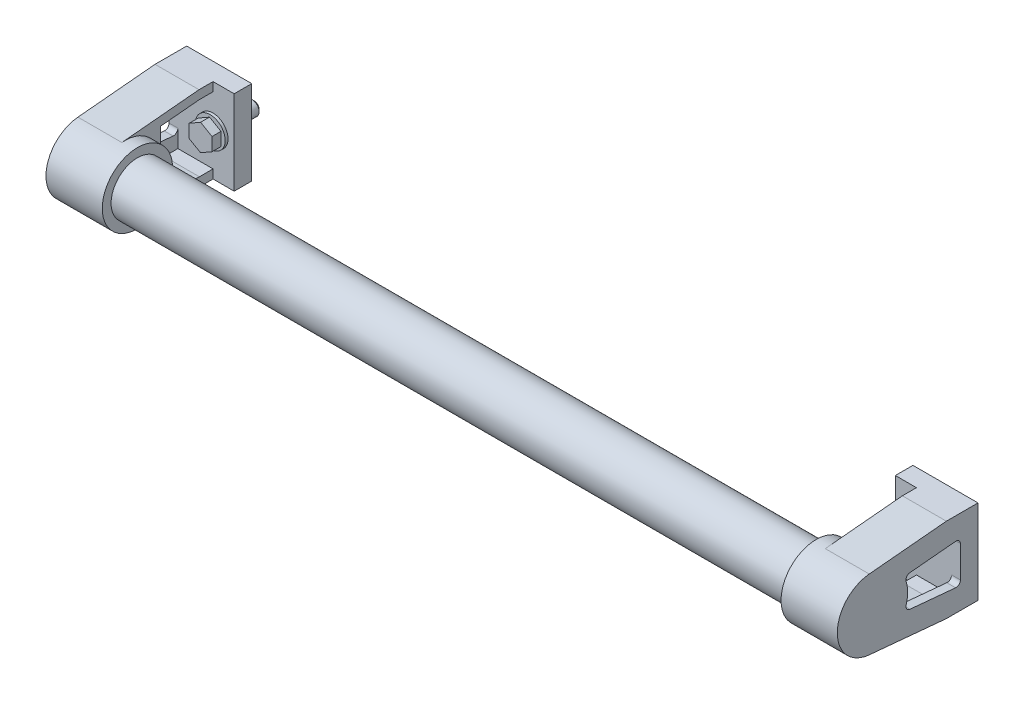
ISO-10303-21;
HEADER;
FILE_DESCRIPTION(('STEP AP214'),'2;1');
FILE_NAME('part.step','',(''),(''),'','','');
FILE_SCHEMA(('AUTOMOTIVE_DESIGN { 1 0 10303 214 1 1 1 1 }'));
ENDSEC;
DATA;
#1=APPLICATION_CONTEXT('core data for automotive mechanical design processes');
#2=APPLICATION_PROTOCOL_DEFINITION('international standard','automotive_design',2000,#1);
#3=PRODUCT_CONTEXT('',#1,'mechanical');
#4=PRODUCT('Part','Part','',(#3));
#5=PRODUCT_RELATED_PRODUCT_CATEGORY('part','',(#4));
#6=PRODUCT_DEFINITION_FORMATION('','',#4);
#7=PRODUCT_DEFINITION_CONTEXT('part definition',#1,'design');
#8=PRODUCT_DEFINITION('design','',#6,#7);
#9=PRODUCT_DEFINITION_SHAPE('','',#8);
#10=(LENGTH_UNIT() NAMED_UNIT(*) SI_UNIT(.MILLI.,.METRE.));
#11=(NAMED_UNIT(*) PLANE_ANGLE_UNIT() SI_UNIT($,.RADIAN.));
#12=(NAMED_UNIT(*) SI_UNIT($,.STERADIAN.) SOLID_ANGLE_UNIT());
#13=UNCERTAINTY_MEASURE_WITH_UNIT(LENGTH_MEASURE(1.E-05),#10,'distance_accuracy_value','');
#14=(GEOMETRIC_REPRESENTATION_CONTEXT(3) GLOBAL_UNCERTAINTY_ASSIGNED_CONTEXT((#13)) GLOBAL_UNIT_ASSIGNED_CONTEXT((#10,
#11,#12)) REPRESENTATION_CONTEXT('',''));
#15=CARTESIAN_POINT('',(0.,0.,0.));
#16=DIRECTION('',(0.,0.,1.));
#17=DIRECTION('',(1.,0.,0.));
#18=AXIS2_PLACEMENT_3D('',#15,#16,#17);
#19=CARTESIAN_POINT('',(16.,-23.9999999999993,18.0000000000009));
#20=DIRECTION('',(0.,0.995687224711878,-0.0927736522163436));
#21=DIRECTION('',(0.,0.0927736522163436,0.995687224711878));
#22=AXIS2_PLACEMENT_3D('',#19,#20,#21);
#23=PLANE('',#22);
#24=DIRECTION('',(0.,0.0927736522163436,0.995687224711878));
#25=VECTOR('',#24,1.);
#26=CARTESIAN_POINT('',(0.,-23.9999999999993,18.0000000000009));
#27=LINE('',#26,#25);
#28=CARTESIAN_POINT('',(0.,-19.9137444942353,61.8554730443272));
#29=VERTEX_POINT('',#28);
#30=CARTESIAN_POINT('',(0.,-23.9999999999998,17.999999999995));
#31=VERTEX_POINT('',#30);
#32=EDGE_CURVE('E651',#29,#31,#27,.F.);
#33=ORIENTED_EDGE('',*,*,#32,.F.);
#34=DIRECTION('',(-1.,0.,0.));
#35=VECTOR('',#34,1.);
#36=CARTESIAN_POINT('',(7.,-19.9137444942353,61.8554730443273));
#37=LINE('',#36,#35);
#38=CARTESIAN_POINT('',(-25.,-19.9137444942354,61.8554730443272));
#39=VERTEX_POINT('',#38);
#40=EDGE_CURVE('E587',#39,#29,#37,.F.);
#41=ORIENTED_EDGE('',*,*,#40,.F.);
#42=DIRECTION('',(0.,0.0927736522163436,0.995687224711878));
#43=VECTOR('',#42,1.);
#44=CARTESIAN_POINT('',(-25.,-23.9999999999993,18.0000000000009));
#45=LINE('',#44,#43);
#46=CARTESIAN_POINT('',(-25.,-24.,17.999999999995));
#47=VERTEX_POINT('',#46);
#48=EDGE_CURVE('E590',#47,#39,#45,.T.);
#49=ORIENTED_EDGE('',*,*,#48,.F.);
#50=DIRECTION('',(1.,0.,0.));
#51=VECTOR('',#50,1.);
#52=CARTESIAN_POINT('',(16.,-24.,17.999999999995));
#53=LINE('',#52,#51);
#54=EDGE_CURVE('E641',#31,#47,#53,.F.);
#55=ORIENTED_EDGE('',*,*,#54,.F.);
#56=EDGE_LOOP('',(#33,#41,#49,#55));
#57=FACE_BOUND('',#56,.T.);
#58=ADVANCED_FACE('F14',(#57),#23,.F.);
#59=CARTESIAN_POINT('',(16.,24.0000000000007,17.999999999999));
#60=DIRECTION('',(0.,0.995687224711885,0.092773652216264));
#61=DIRECTION('',(0.,-0.092773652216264,0.995687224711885));
#62=AXIS2_PLACEMENT_3D('',#59,#60,#61);
#63=PLANE('',#62);
#64=DIRECTION('',(1.,0.,0.));
#65=VECTOR('',#64,1.);
#66=CARTESIAN_POINT('',(16.,19.9137444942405,61.8554730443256));
#67=LINE('',#66,#65);
#68=CARTESIAN_POINT('',(-25.,19.9137444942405,61.8554730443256));
#69=VERTEX_POINT('',#68);
#70=CARTESIAN_POINT('',(0.,19.9137444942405,61.8554730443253));
#71=VERTEX_POINT('',#70);
#72=EDGE_CURVE('E582',#69,#71,#67,.T.);
#73=ORIENTED_EDGE('',*,*,#72,.T.);
#74=DIRECTION('',(0.,-0.092773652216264,0.995687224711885));
#75=VECTOR('',#74,1.);
#76=CARTESIAN_POINT('',(0.,24.0000000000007,17.999999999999));
#77=LINE('',#76,#75);
#78=CARTESIAN_POINT('',(0.,24.0000000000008,17.999999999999));
#79=VERTEX_POINT('',#78);
#80=EDGE_CURVE('E619',#71,#79,#77,.F.);
#81=ORIENTED_EDGE('',*,*,#80,.T.);
#82=DIRECTION('',(1.,0.,0.));
#83=VECTOR('',#82,1.);
#84=CARTESIAN_POINT('',(16.,24.0000000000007,17.999999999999));
#85=LINE('',#84,#83);
#86=CARTESIAN_POINT('',(-25.,24.0000000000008,17.999999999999));
#87=VERTEX_POINT('',#86);
#88=EDGE_CURVE('E593',#79,#87,#85,.F.);
#89=ORIENTED_EDGE('',*,*,#88,.T.);
#90=DIRECTION('',(0.,-0.092773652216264,0.995687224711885));
#91=VECTOR('',#90,1.);
#92=CARTESIAN_POINT('',(-25.,24.0000000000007,17.999999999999));
#93=LINE('',#92,#91);
#94=EDGE_CURVE('E586',#87,#69,#93,.T.);
#95=ORIENTED_EDGE('',*,*,#94,.T.);
#96=EDGE_LOOP('',(#73,#81,#89,#95));
#97=FACE_BOUND('',#96,.T.);
#98=ADVANCED_FACE('F1416',(#97),#63,.T.);
#99=CARTESIAN_POINT('',(7.,2.62290189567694E-12,60.));
#100=DIRECTION('',(-1.,0.,0.));
#101=DIRECTION('',(0.,0.,1.));
#102=AXIS2_PLACEMENT_3D('',#99,#100,#101);
#103=PLANE('',#102);
#104=CARTESIAN_POINT('',(7.,2.62290189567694E-12,60.));
#105=DIRECTION('',(1.,0.,0.));
#106=DIRECTION('',(0.,0.,-1.));
#107=AXIS2_PLACEMENT_3D('',#104,#105,#106);
#108=CIRCLE('',#107,15.);
#109=CARTESIAN_POINT('',(7.,2.62290189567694E-12,45.));
#110=VERTEX_POINT('',#109);
#111=EDGE_CURVE('E9',#110,#110,#108,.T.);
#112=ORIENTED_EDGE('',*,*,#111,.F.);
#113=EDGE_LOOP('',(#112));
#114=FACE_BOUND('',#113,.T.);
#115=CARTESIAN_POINT('',(7.,2.62290189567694E-12,60.));
#116=DIRECTION('',(-1.,0.,0.));
#117=DIRECTION('',(0.,0.,1.));
#118=AXIS2_PLACEMENT_3D('',#115,#116,#117);
#119=CIRCLE('',#118,20.0000000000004);
#120=CARTESIAN_POINT('',(7.,2.62290189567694E-12,80.0000000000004));
#121=VERTEX_POINT('',#120);
#122=EDGE_CURVE('E585',#121,#121,#119,.T.);
#123=ORIENTED_EDGE('',*,*,#122,.F.);
#124=EDGE_LOOP('',(#123));
#125=FACE_BOUND('',#124,.T.);
#126=ADVANCED_FACE('F1426',(#114,#125),#103,.F.);
#127=CARTESIAN_POINT('',(-6.5,4.9960036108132E-13,12.));
#128=DIRECTION('',(0.,0.,-1.));
#129=DIRECTION('',(0.,1.,0.));
#130=AXIS2_PLACEMENT_3D('',#127,#128,#129);
#131=PLANE('',#130);
#132=CARTESIAN_POINT('',(0.,4.99600361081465E-13,12.));
#133=DIRECTION('',(0.,0.,1.));
#134=DIRECTION('',(0.,-1.,0.));
#135=AXIS2_PLACEMENT_3D('',#132,#133,#134);
#136=CIRCLE('',#135,5.85000000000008);
#137=CARTESIAN_POINT('',(0.,-5.84999999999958,12.0000000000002));
#138=VERTEX_POINT('',#137);
#139=EDGE_CURVE('E566',#138,#138,#136,.F.);
#140=ORIENTED_EDGE('',*,*,#139,.F.);
#141=EDGE_LOOP('',(#140));
#142=FACE_BOUND('',#141,.T.);
#143=DIRECTION('',(0.866025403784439,0.5,0.));
#144=VECTOR('',#143,1.);
#145=CARTESIAN_POINT('',(0.,-7.50555349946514,12.));
#146=LINE('',#145,#144);
#147=CARTESIAN_POINT('',(0.,-7.50555349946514,12.));
#148=VERTEX_POINT('',#147);
#149=CARTESIAN_POINT('',(6.5,-3.75277674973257,12.));
#150=VERTEX_POINT('',#149);
#151=EDGE_CURVE('E1953',#148,#150,#146,.T.);
#152=ORIENTED_EDGE('',*,*,#151,.F.);
#153=DIRECTION('',(0.866025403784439,-0.5,0.));
#154=VECTOR('',#153,1.);
#155=CARTESIAN_POINT('',(-6.5,-3.75277674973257,12.));
#156=LINE('',#155,#154);
#157=CARTESIAN_POINT('',(-6.5,-3.75277674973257,12.));
#158=VERTEX_POINT('',#157);
#159=EDGE_CURVE('E1946',#158,#148,#156,.T.);
#160=ORIENTED_EDGE('',*,*,#159,.F.);
#161=DIRECTION('',(0.,-1.,0.));
#162=VECTOR('',#161,1.);
#163=CARTESIAN_POINT('',(-6.5,3.75277674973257,12.));
#164=LINE('',#163,#162);
#165=CARTESIAN_POINT('',(-6.5,3.75277674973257,12.));
#166=VERTEX_POINT('',#165);
#167=EDGE_CURVE('E1954',#166,#158,#164,.T.);
#168=ORIENTED_EDGE('',*,*,#167,.F.);
#169=DIRECTION('',(-0.866025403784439,-0.5,0.));
#170=VECTOR('',#169,1.);
#171=CARTESIAN_POINT('',(0.,7.50555349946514,12.));
#172=LINE('',#171,#170);
#173=CARTESIAN_POINT('',(0.,7.50555349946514,12.));
#174=VERTEX_POINT('',#173);
#175=EDGE_CURVE('E1959',#174,#166,#172,.T.);
#176=ORIENTED_EDGE('',*,*,#175,.F.);
#177=DIRECTION('',(-0.866025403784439,0.5,0.));
#178=VECTOR('',#177,1.);
#179=CARTESIAN_POINT('',(6.5,3.75277674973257,12.));
#180=LINE('',#179,#178);
#181=CARTESIAN_POINT('',(6.5,3.75277674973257,12.));
#182=VERTEX_POINT('',#181);
#183=EDGE_CURVE('E562',#182,#174,#180,.T.);
#184=ORIENTED_EDGE('',*,*,#183,.F.);
#185=DIRECTION('',(0.,1.,0.));
#186=VECTOR('',#185,1.);
#187=CARTESIAN_POINT('',(6.5,-3.75277674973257,12.));
#188=LINE('',#187,#186);
#189=EDGE_CURVE('E549',#150,#182,#188,.T.);
#190=ORIENTED_EDGE('',*,*,#189,.F.);
#191=EDGE_LOOP('',(#152,#160,#168,#176,#184,#190));
#192=FACE_BOUND('',#191,.T.);
#193=ADVANCED_FACE('F1692',(#142,#192),#131,.T.);
#194=CARTESIAN_POINT('',(0.,3.33066907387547E-12,80.));
#195=DIRECTION('',(0.,0.,1.));
#196=DIRECTION('',(0.,-1.,0.));
#197=AXIS2_PLACEMENT_3D('',#194,#195,#196);
#198=CYLINDRICAL_SURFACE('',#197,5.85000000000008);
#199=ORIENTED_EDGE('',*,*,#139,.T.);
#200=EDGE_LOOP('',(#199));
#201=FACE_BOUND('',#200,.T.);
#202=CARTESIAN_POINT('',(0.,4.82947015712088E-13,11.6));
#203=DIRECTION('',(0.,0.,1.));
#204=DIRECTION('',(0.,-1.,0.));
#205=AXIS2_PLACEMENT_3D('',#202,#203,#204);
#206=CIRCLE('',#205,5.85000000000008);
#207=CARTESIAN_POINT('',(0.,-5.8499999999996,11.6000000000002));
#208=VERTEX_POINT('',#207);
#209=EDGE_CURVE('E880',#208,#208,#206,.F.);
#210=ORIENTED_EDGE('',*,*,#209,.F.);
#211=EDGE_LOOP('',(#210));
#212=FACE_BOUND('',#211,.T.);
#213=ADVANCED_FACE('F1682',(#201,#212),#198,.T.);
#214=CARTESIAN_POINT('',(-5.85,4.71844785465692E-13,11.6));
#215=DIRECTION('',(0.,0.,1.));
#216=DIRECTION('',(0.,-1.,0.));
#217=AXIS2_PLACEMENT_3D('',#214,#215,#216);
#218=PLANE('',#217);
#219=CARTESIAN_POINT('',(0.,4.82947015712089E-13,11.6));
#220=DIRECTION('',(0.,0.,1.));
#221=DIRECTION('',(0.,-1.,0.));
#222=AXIS2_PLACEMENT_3D('',#219,#220,#221);
#223=CIRCLE('',#222,8.50000000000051);
#224=CARTESIAN_POINT('',(0.,-8.50000000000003,11.6000000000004));
#225=VERTEX_POINT('',#224);
#226=EDGE_CURVE('E827',#225,#225,#223,.F.);
#227=ORIENTED_EDGE('',*,*,#226,.F.);
#228=EDGE_LOOP('',(#227));
#229=FACE_BOUND('',#228,.T.);
#230=ORIENTED_EDGE('',*,*,#209,.T.);
#231=EDGE_LOOP('',(#230));
#232=FACE_BOUND('',#231,.T.);
#233=ADVANCED_FACE('F1672',(#229,#232),#218,.T.);
#234=CARTESIAN_POINT('',(0.,5.27355936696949E-13,12.7319341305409));
#235=DIRECTION('',(0.,0.,1.));
#236=DIRECTION('',(0.,-1.,0.));
#237=AXIS2_PLACEMENT_3D('',#234,#235,#236);
#238=CYLINDRICAL_SURFACE('',#237,3.99999999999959);
#239=CARTESIAN_POINT('',(0.,-5.10644337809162E-13,-12.2));
#240=DIRECTION('',(0.,0.,1.));
#241=DIRECTION('',(0.,-1.,0.));
#242=AXIS2_PLACEMENT_3D('',#239,#240,#241);
#243=CIRCLE('',#242,3.99999999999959);
#244=CARTESIAN_POINT('',(0.,-4.0000000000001,-12.1999999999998));
#245=VERTEX_POINT('',#244);
#246=EDGE_CURVE('E851',#245,#245,#243,.T.);
#247=ORIENTED_EDGE('',*,*,#246,.T.);
#248=EDGE_LOOP('',(#247));
#249=FACE_BOUND('',#248,.T.);
#250=CARTESIAN_POINT('',(0.,0.,0.));
#251=DIRECTION('',(0.,0.,1.));
#252=DIRECTION('',(0.,-1.,0.));
#253=AXIS2_PLACEMENT_3D('',#250,#251,#252);
#254=CIRCLE('',#253,3.99999999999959);
#255=CARTESIAN_POINT('',(0.,-3.99999999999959,1.1102230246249E-13));
#256=VERTEX_POINT('',#255);
#257=EDGE_CURVE('E722',#256,#256,#254,.T.);
#258=ORIENTED_EDGE('',*,*,#257,.F.);
#259=EDGE_LOOP('',(#258));
#260=FACE_BOUND('',#259,.T.);
#261=ADVANCED_FACE('F1662',(#249,#260),#238,.T.);
#262=CARTESIAN_POINT('',(0.,3.33066907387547E-12,80.));
#263=DIRECTION('',(0.,0.,1.));
#264=DIRECTION('',(0.,-1.,0.));
#265=AXIS2_PLACEMENT_3D('',#262,#263,#264);
#266=CYLINDRICAL_SURFACE('',#265,8.50000000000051);
#267=ORIENTED_EDGE('',*,*,#226,.T.);
#268=EDGE_LOOP('',(#267));
#269=FACE_BOUND('',#268,.T.);
#270=CARTESIAN_POINT('',(0.,4.16333634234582E-13,10.));
#271=DIRECTION('',(0.,0.,1.));
#272=DIRECTION('',(0.,-1.,0.));
#273=AXIS2_PLACEMENT_3D('',#270,#271,#272);
#274=CIRCLE('',#273,8.50000000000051);
#275=CARTESIAN_POINT('',(0.,-8.50000000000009,10.0000000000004));
#276=VERTEX_POINT('',#275);
#277=EDGE_CURVE('E688',#276,#276,#274,.T.);
#278=ORIENTED_EDGE('',*,*,#277,.T.);
#279=EDGE_LOOP('',(#278));
#280=FACE_BOUND('',#279,.T.);
#281=ADVANCED_FACE('F1652',(#269,#280),#266,.T.);
#282=CARTESIAN_POINT('',(-20.,-18.9999999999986,40.0000000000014));
#283=DIRECTION('',(1.,0.,0.));
#284=DIRECTION('',(0.,0.,-1.));
#285=AXIS2_PLACEMENT_3D('',#282,#283,#284);
#286=PLANE('',#285);
#287=DIRECTION('',(0.,1.,0.));
#288=VECTOR('',#287,1.);
#289=CARTESIAN_POINT('',(-20.,-23.9999999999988,40.0000000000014));
#290=LINE('',#289,#288);
#291=CARTESIAN_POINT('',(-20.,-16.9284817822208,40.0000000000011));
#292=VERTEX_POINT('',#291);
#293=CARTESIAN_POINT('',(-20.,-8.50076165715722,40.0000000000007));
#294=VERTEX_POINT('',#293);
#295=EDGE_CURVE('E792',#292,#294,#290,.T.);
#296=ORIENTED_EDGE('',*,*,#295,.F.);
#297=DIRECTION('',(0.,-0.0927736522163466,-0.995687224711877));
#298=VECTOR('',#297,1.);
#299=CARTESIAN_POINT('',(-20.,-18.9999999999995,17.7675646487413));
#300=LINE('',#299,#298);
#301=CARTESIAN_POINT('',(-20.,-18.9999999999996,17.7675646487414));
#302=VERTEX_POINT('',#301);
#303=EDGE_CURVE('E802',#292,#302,#300,.T.);
#304=ORIENTED_EDGE('',*,*,#303,.T.);
#305=DIRECTION('',(0.,0.,-1.));
#306=VECTOR('',#305,1.);
#307=CARTESIAN_POINT('',(-20.,-19.,10.0000000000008));
#308=LINE('',#307,#306);
#309=CARTESIAN_POINT('',(-20.,-19.,10.0000000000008));
#310=VERTEX_POINT('',#309);
#311=EDGE_CURVE('E824',#302,#310,#308,.T.);
#312=ORIENTED_EDGE('',*,*,#311,.T.);
#313=DIRECTION('',(0.,1.,0.));
#314=VECTOR('',#313,1.);
#315=CARTESIAN_POINT('',(-20.,-8.94532766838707,10.0000000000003));
#316=LINE('',#315,#314);
#317=CARTESIAN_POINT('',(-20.,-8.94532766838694,10.0000000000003));
#318=VERTEX_POINT('',#317);
#319=EDGE_CURVE('E682',#310,#318,#316,.T.);
#320=ORIENTED_EDGE('',*,*,#319,.T.);
#321=CARTESIAN_POINT('',(-20.,-8.94532766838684,12.5000000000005));
#322=DIRECTION('',(-1.,0.,0.));
#323=DIRECTION('',(0.,0.,1.));
#324=AXIS2_PLACEMENT_3D('',#321,#322,#323);
#325=CIRCLE('',#324,2.5);
#326=CARTESIAN_POINT('',(-20.,-11.4345457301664,12.7319341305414));
#327=VERTEX_POINT('',#326);
#328=EDGE_CURVE('E689',#318,#327,#325,.T.);
#329=ORIENTED_EDGE('',*,*,#328,.T.);
#330=DIRECTION('',(0.,0.0927736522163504,0.995687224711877));
#331=VECTOR('',#330,1.);
#332=CARTESIAN_POINT('',(-20.,-11.4345457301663,12.7319341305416));
#333=LINE('',#332,#331);
#334=CARTESIAN_POINT('',(-20.,-9.01504355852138,38.6990847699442));
#335=VERTEX_POINT('',#334);
#336=EDGE_CURVE('E693',#335,#327,#333,.F.);
#337=ORIENTED_EDGE('',*,*,#336,.F.);
#338=CARTESIAN_POINT('',(-20.,-6.52582549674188,38.4671506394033));
#339=DIRECTION('',(-1.,0.,0.));
#340=DIRECTION('',(0.,0.,1.));
#341=AXIS2_PLACEMENT_3D('',#338,#339,#340);
#342=CIRCLE('',#341,2.5);
#343=EDGE_CURVE('E698',#335,#294,#342,.T.);
#344=ORIENTED_EDGE('',*,*,#343,.T.);
#345=EDGE_LOOP('',(#296,#304,#312,#320,#329,#337,#344));
#346=FACE_BOUND('',#345,.T.);
#347=ADVANCED_FACE('F1642',(#346),#286,.T.);
#348=CARTESIAN_POINT('',(-20.,-18.9999999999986,40.0000000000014));
#349=DIRECTION('',(1.,0.,0.));
#350=DIRECTION('',(0.,0.,-1.));
#351=AXIS2_PLACEMENT_3D('',#348,#349,#350);
#352=PLANE('',#351);
#353=DIRECTION('',(0.,1.,0.));
#354=VECTOR('',#353,1.);
#355=CARTESIAN_POINT('',(-20.,-8.94532766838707,10.0000000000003));
#356=LINE('',#355,#354);
#357=CARTESIAN_POINT('',(-20.,8.94532766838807,9.99999999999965));
#358=VERTEX_POINT('',#357);
#359=CARTESIAN_POINT('',(-20.,19.0000000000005,9.99999999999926));
#360=VERTEX_POINT('',#359);
#361=EDGE_CURVE('E685',#358,#360,#356,.T.);
#362=ORIENTED_EDGE('',*,*,#361,.T.);
#363=DIRECTION('',(0.,0.,-1.));
#364=VECTOR('',#363,1.);
#365=CARTESIAN_POINT('',(-20.,19.0000000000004,9.99999999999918));
#366=LINE('',#365,#364);
#367=CARTESIAN_POINT('',(-20.,19.0000000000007,17.7675646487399));
#368=VERTEX_POINT('',#367);
#369=EDGE_CURVE('E760',#368,#360,#366,.T.);
#370=ORIENTED_EDGE('',*,*,#369,.F.);
#371=DIRECTION('',(0.,0.0927736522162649,-0.995687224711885));
#372=VECTOR('',#371,1.);
#373=CARTESIAN_POINT('',(-20.,19.0000000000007,17.7675646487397));
#374=LINE('',#373,#372);
#375=CARTESIAN_POINT('',(-20.,16.9284817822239,40.));
#376=VERTEX_POINT('',#375);
#377=EDGE_CURVE('E761',#376,#368,#374,.T.);
#378=ORIENTED_EDGE('',*,*,#377,.F.);
#379=DIRECTION('',(0.,1.,0.));
#380=VECTOR('',#379,1.);
#381=CARTESIAN_POINT('',(-20.,-23.9999999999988,40.0000000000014));
#382=LINE('',#381,#380);
#383=CARTESIAN_POINT('',(-20.,8.50076165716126,40.));
#384=VERTEX_POINT('',#383);
#385=EDGE_CURVE('E771',#384,#376,#382,.T.);
#386=ORIENTED_EDGE('',*,*,#385,.F.);
#387=CARTESIAN_POINT('',(-20.,6.52582549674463,38.4671506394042));
#388=DIRECTION('',(-1.,0.,0.));
#389=DIRECTION('',(0.,0.,1.));
#390=AXIS2_PLACEMENT_3D('',#387,#388,#389);
#391=CIRCLE('',#390,2.5);
#392=CARTESIAN_POINT('',(-20.,9.01504355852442,38.699084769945));
#393=VERTEX_POINT('',#392);
#394=EDGE_CURVE('E699',#384,#393,#391,.T.);
#395=ORIENTED_EDGE('',*,*,#394,.T.);
#396=DIRECTION('',(0.,-0.0927736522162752,0.995687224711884));
#397=VECTOR('',#396,1.);
#398=CARTESIAN_POINT('',(-20.,11.4345457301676,12.7319341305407));
#399=LINE('',#398,#397);
#400=CARTESIAN_POINT('',(-20.,11.4345457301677,12.7319341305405));
#401=VERTEX_POINT('',#400);
#402=EDGE_CURVE('E703',#393,#401,#399,.F.);
#403=ORIENTED_EDGE('',*,*,#402,.T.);
#404=CARTESIAN_POINT('',(-20.,8.94532766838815,12.4999999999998));
#405=DIRECTION('',(-1.,0.,0.));
#406=DIRECTION('',(0.,0.,1.));
#407=AXIS2_PLACEMENT_3D('',#404,#405,#406);
#408=CIRCLE('',#407,2.5);
#409=EDGE_CURVE('E721',#401,#358,#408,.T.);
#410=ORIENTED_EDGE('',*,*,#409,.T.);
#411=EDGE_LOOP('',(#362,#370,#378,#386,#395,#403,#410));
#412=FACE_BOUND('',#411,.T.);
#413=ADVANCED_FACE('F1632',(#412),#352,.T.);
#414=CARTESIAN_POINT('',(-11.,-19.,10.0000000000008));
#415=DIRECTION('',(0.,-1.,0.));
#416=DIRECTION('',(0.,0.,-1.));
#417=AXIS2_PLACEMENT_3D('',#414,#415,#416);
#418=PLANE('',#417);
#419=ORIENTED_EDGE('',*,*,#311,.F.);
#420=DIRECTION('',(1.,0.,0.));
#421=VECTOR('',#420,1.);
#422=CARTESIAN_POINT('',(-11.,-18.9999999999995,17.7675646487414));
#423=LINE('',#422,#421);
#424=CARTESIAN_POINT('',(0.,-19.,17.7675646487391));
#425=VERTEX_POINT('',#424);
#426=EDGE_CURVE('E793',#302,#425,#423,.T.);
#427=ORIENTED_EDGE('',*,*,#426,.T.);
#428=DIRECTION('',(0.,0.,-1.));
#429=VECTOR('',#428,1.);
#430=CARTESIAN_POINT('',(0.,-19.,38.4671506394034));
#431=LINE('',#430,#429);
#432=CARTESIAN_POINT('',(0.,-19.,10.0000000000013));
#433=VERTEX_POINT('',#432);
#434=EDGE_CURVE('E776',#433,#425,#431,.F.);
#435=ORIENTED_EDGE('',*,*,#434,.F.);
#436=DIRECTION('',(1.,0.,0.));
#437=VECTOR('',#436,1.);
#438=CARTESIAN_POINT('',(16.,-19.,10.0000000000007));
#439=LINE('',#438,#437);
#440=EDGE_CURVE('E736',#433,#310,#439,.F.);
#441=ORIENTED_EDGE('',*,*,#440,.T.);
#442=EDGE_LOOP('',(#419,#427,#435,#441));
#443=FACE_BOUND('',#442,.T.);
#444=ADVANCED_FACE('F1622',(#443),#418,.F.);
#445=CARTESIAN_POINT('',(-11.,-18.9999999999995,17.7675646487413));
#446=DIRECTION('',(0.,-0.995687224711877,0.0927736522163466));
#447=DIRECTION('',(0.,-0.0927736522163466,-0.995687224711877));
#448=AXIS2_PLACEMENT_3D('',#445,#446,#447);
#449=PLANE('',#448);
#450=ORIENTED_EDGE('',*,*,#303,.F.);
#451=DIRECTION('',(1.,0.,0.));
#452=VECTOR('',#451,1.);
#453=CARTESIAN_POINT('',(3.99999999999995,-16.9284817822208,40.0000000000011));
#454=LINE('',#453,#452);
#455=CARTESIAN_POINT('',(0.,-16.9284817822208,40.0000000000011));
#456=VERTEX_POINT('',#455);
#457=EDGE_CURVE('E789',#456,#292,#454,.F.);
#458=ORIENTED_EDGE('',*,*,#457,.F.);
#459=DIRECTION('',(0.,0.0927736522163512,0.995687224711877));
#460=VECTOR('',#459,1.);
#461=CARTESIAN_POINT('',(0.,-18.9999999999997,17.7675646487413));
#462=LINE('',#461,#460);
#463=EDGE_CURVE('E669',#425,#456,#462,.T.);
#464=ORIENTED_EDGE('',*,*,#463,.F.);
#465=ORIENTED_EDGE('',*,*,#426,.F.);
#466=EDGE_LOOP('',(#450,#458,#464,#465));
#467=FACE_BOUND('',#466,.T.);
#468=ADVANCED_FACE('F1612',(#467),#449,.F.);
#469=CARTESIAN_POINT('',(3.99999999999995,-23.9999999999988,40.0000000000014));
#470=DIRECTION('',(0.,0.,-1.));
#471=DIRECTION('',(0.,1.,0.));
#472=AXIS2_PLACEMENT_3D('',#469,#470,#471);
#473=PLANE('',#472);
#474=ORIENTED_EDGE('',*,*,#457,.T.);
#475=ORIENTED_EDGE('',*,*,#295,.T.);
#476=DIRECTION('',(-1.,0.,0.));
#477=VECTOR('',#476,1.);
#478=CARTESIAN_POINT('',(16.,-8.50076165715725,40.0000000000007));
#479=LINE('',#478,#477);
#480=CARTESIAN_POINT('',(0.,-8.50076165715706,40.0000000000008));
#481=VERTEX_POINT('',#480);
#482=EDGE_CURVE('E694',#294,#481,#479,.F.);
#483=ORIENTED_EDGE('',*,*,#482,.T.);
#484=DIRECTION('',(0.,1.,0.));
#485=VECTOR('',#484,1.);
#486=CARTESIAN_POINT('',(0.,-6.52582549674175,40.0000000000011));
#487=LINE('',#486,#485);
#488=EDGE_CURVE('E665',#456,#481,#487,.T.);
#489=ORIENTED_EDGE('',*,*,#488,.F.);
#490=EDGE_LOOP('',(#474,#475,#483,#489));
#491=FACE_BOUND('',#490,.T.);
#492=ADVANCED_FACE('F1602',(#491),#473,.T.);
#493=CARTESIAN_POINT('',(3.99999999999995,-23.9999999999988,40.0000000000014));
#494=DIRECTION('',(0.,0.,-1.));
#495=DIRECTION('',(0.,1.,0.));
#496=AXIS2_PLACEMENT_3D('',#493,#494,#495);
#497=PLANE('',#496);
#498=DIRECTION('',(-1.,0.,0.));
#499=VECTOR('',#498,1.);
#500=CARTESIAN_POINT('',(16.,8.50076165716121,40.));
#501=LINE('',#500,#499);
#502=CARTESIAN_POINT('',(0.,8.50076165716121,40.));
#503=VERTEX_POINT('',#502);
#504=EDGE_CURVE('E702',#503,#384,#501,.T.);
#505=ORIENTED_EDGE('',*,*,#504,.T.);
#506=ORIENTED_EDGE('',*,*,#385,.T.);
#507=DIRECTION('',(1.,0.,0.));
#508=VECTOR('',#507,1.);
#509=CARTESIAN_POINT('',(-11.,16.9284817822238,40.));
#510=LINE('',#509,#508);
#511=CARTESIAN_POINT('',(0.,16.9284817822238,40.));
#512=VERTEX_POINT('',#511);
#513=EDGE_CURVE('E768',#512,#376,#510,.F.);
#514=ORIENTED_EDGE('',*,*,#513,.F.);
#515=DIRECTION('',(0.,1.,0.));
#516=VECTOR('',#515,1.);
#517=CARTESIAN_POINT('',(0.,2.62290189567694E-12,40.));
#518=LINE('',#517,#516);
#519=EDGE_CURVE('E633',#503,#512,#518,.T.);
#520=ORIENTED_EDGE('',*,*,#519,.F.);
#521=EDGE_LOOP('',(#505,#506,#514,#520));
#522=FACE_BOUND('',#521,.T.);
#523=ADVANCED_FACE('F1592',(#522),#497,.T.);
#524=CARTESIAN_POINT('',(-11.,19.0000000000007,17.7675646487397));
#525=DIRECTION('',(0.,-0.995687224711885,-0.0927736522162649));
#526=DIRECTION('',(0.,0.0927736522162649,-0.995687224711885));
#527=AXIS2_PLACEMENT_3D('',#524,#525,#526);
#528=PLANE('',#527);
#529=DIRECTION('',(1.,0.,0.));
#530=VECTOR('',#529,1.);
#531=CARTESIAN_POINT('',(-11.,19.0000000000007,17.7675646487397));
#532=LINE('',#531,#530);
#533=CARTESIAN_POINT('',(0.,19.0000000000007,17.7675646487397));
#534=VERTEX_POINT('',#533);
#535=EDGE_CURVE('E757',#534,#368,#532,.F.);
#536=ORIENTED_EDGE('',*,*,#535,.F.);
#537=DIRECTION('',(0.,0.0927736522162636,-0.995687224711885));
#538=VECTOR('',#537,1.);
#539=CARTESIAN_POINT('',(0.,16.9284817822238,40.));
#540=LINE('',#539,#538);
#541=EDGE_CURVE('E636',#512,#534,#540,.T.);
#542=ORIENTED_EDGE('',*,*,#541,.F.);
#543=ORIENTED_EDGE('',*,*,#513,.T.);
#544=ORIENTED_EDGE('',*,*,#377,.T.);
#545=EDGE_LOOP('',(#536,#542,#543,#544));
#546=FACE_BOUND('',#545,.T.);
#547=ADVANCED_FACE('F1582',(#546),#528,.T.);
#548=CARTESIAN_POINT('',(-11.,19.0000000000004,9.99999999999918));
#549=DIRECTION('',(0.,-1.,0.));
#550=DIRECTION('',(0.,0.,-1.));
#551=AXIS2_PLACEMENT_3D('',#548,#549,#550);
#552=PLANE('',#551);
#553=DIRECTION('',(1.,0.,0.));
#554=VECTOR('',#553,1.);
#555=CARTESIAN_POINT('',(16.,19.0000000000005,9.99999999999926));
#556=LINE('',#555,#554);
#557=CARTESIAN_POINT('',(0.,19.0000000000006,9.99999999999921));
#558=VERTEX_POINT('',#557);
#559=EDGE_CURVE('E747',#360,#558,#556,.T.);
#560=ORIENTED_EDGE('',*,*,#559,.T.);
#561=DIRECTION('',(0.,0.,-1.));
#562=VECTOR('',#561,1.);
#563=CARTESIAN_POINT('',(0.,19.0000000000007,60.));
#564=LINE('',#563,#562);
#565=EDGE_CURVE('E742',#534,#558,#564,.T.);
#566=ORIENTED_EDGE('',*,*,#565,.F.);
#567=ORIENTED_EDGE('',*,*,#535,.T.);
#568=ORIENTED_EDGE('',*,*,#369,.T.);
#569=EDGE_LOOP('',(#560,#566,#567,#568));
#570=FACE_BOUND('',#569,.T.);
#571=ADVANCED_FACE('F1572',(#570),#552,.T.);
#572=CARTESIAN_POINT('',(12.,-24.,10.0000000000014));
#573=DIRECTION('',(1.,0.,0.));
#574=DIRECTION('',(0.,0.,-1.));
#575=AXIS2_PLACEMENT_3D('',#572,#573,#574);
#576=PLANE('',#575);
#577=DIRECTION('',(0.,1.,0.));
#578=VECTOR('',#577,1.);
#579=CARTESIAN_POINT('',(12.,-24.0000000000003,9.43689570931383E-13));
#580=LINE('',#579,#578);
#581=CARTESIAN_POINT('',(12.,24.,-1.0177044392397E-12));
#582=VERTEX_POINT('',#581);
#583=CARTESIAN_POINT('',(12.,-24.0000000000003,9.43689570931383E-13));
#584=VERTEX_POINT('',#583);
#585=EDGE_CURVE('E718',#582,#584,#580,.F.);
#586=ORIENTED_EDGE('',*,*,#585,.F.);
#587=DIRECTION('',(0.,0.,1.));
#588=VECTOR('',#587,1.);
#589=CARTESIAN_POINT('',(12.,24.,-1.0547118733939E-12));
#590=LINE('',#589,#588);
#591=CARTESIAN_POINT('',(12.,24.0000000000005,9.99999999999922));
#592=VERTEX_POINT('',#591);
#593=EDGE_CURVE('E706',#592,#582,#590,.F.);
#594=ORIENTED_EDGE('',*,*,#593,.F.);
#595=DIRECTION('',(0.,1.,0.));
#596=VECTOR('',#595,1.);
#597=CARTESIAN_POINT('',(12.,-8.94532766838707,10.0000000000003));
#598=LINE('',#597,#596);
#599=CARTESIAN_POINT('',(12.,-24.,10.0000000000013));
#600=VERTEX_POINT('',#599);
#601=EDGE_CURVE('E733',#592,#600,#598,.F.);
#602=ORIENTED_EDGE('',*,*,#601,.T.);
#603=DIRECTION('',(0.,0.,1.));
#604=VECTOR('',#603,1.);
#605=CARTESIAN_POINT('',(12.,-24.0000000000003,9.43689570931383E-13));
#606=LINE('',#605,#604);
#607=EDGE_CURVE('E715',#600,#584,#606,.F.);
#608=ORIENTED_EDGE('',*,*,#607,.T.);
#609=EDGE_LOOP('',(#586,#594,#602,#608));
#610=FACE_BOUND('',#609,.T.);
#611=ADVANCED_FACE('F1562',(#610),#576,.T.);
#612=CARTESIAN_POINT('',(16.,-24.0000000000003,9.43689570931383E-13));
#613=DIRECTION('',(0.,0.,-1.));
#614=DIRECTION('',(0.,1.,0.));
#615=AXIS2_PLACEMENT_3D('',#612,#613,#614);
#616=PLANE('',#615);
#617=DIRECTION('',(1.,0.,0.));
#618=VECTOR('',#617,1.);
#619=CARTESIAN_POINT('',(16.,-24.0000000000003,9.43689570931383E-13));
#620=LINE('',#619,#618);
#621=CARTESIAN_POINT('',(-25.,-24.0000000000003,-3.88578058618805E-13));
#622=VERTEX_POINT('',#621);
#623=EDGE_CURVE('E657',#584,#622,#620,.F.);
#624=ORIENTED_EDGE('',*,*,#623,.T.);
#625=DIRECTION('',(0.,1.,0.));
#626=VECTOR('',#625,1.);
#627=CARTESIAN_POINT('',(-25.,2.62290189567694E-12,-1.0547118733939E-12));
#628=LINE('',#627,#626);
#629=CARTESIAN_POINT('',(-25.,24.0000000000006,-1.0547118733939E-12));
#630=VERTEX_POINT('',#629);
#631=EDGE_CURVE('E613',#630,#622,#628,.F.);
#632=ORIENTED_EDGE('',*,*,#631,.F.);
#633=DIRECTION('',(1.,0.,0.));
#634=VECTOR('',#633,1.);
#635=CARTESIAN_POINT('',(16.,24.,-1.0547118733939E-12));
#636=LINE('',#635,#634);
#637=EDGE_CURVE('E646',#582,#630,#636,.F.);
#638=ORIENTED_EDGE('',*,*,#637,.F.);
#639=ORIENTED_EDGE('',*,*,#585,.T.);
#640=EDGE_LOOP('',(#624,#632,#638,#639));
#641=FACE_BOUND('',#640,.T.);
#642=ORIENTED_EDGE('',*,*,#257,.T.);
#643=EDGE_LOOP('',(#642));
#644=FACE_BOUND('',#643,.T.);
#645=ADVANCED_FACE('F1552',(#641,#644),#616,.T.);
#646=CARTESIAN_POINT('',(7.,8.94532766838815,12.4999999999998));
#647=DIRECTION('',(-1.,0.,0.));
#648=DIRECTION('',(0.,0.,1.));
#649=AXIS2_PLACEMENT_3D('',#646,#647,#648);
#650=CYLINDRICAL_SURFACE('',#649,2.5);
#651=DIRECTION('',(1.,0.,0.));
#652=VECTOR('',#651,1.);
#653=CARTESIAN_POINT('',(7.,11.4345457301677,12.7319341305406));
#654=LINE('',#653,#652);
#655=CARTESIAN_POINT('',(-25.,11.4345457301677,12.7319341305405));
#656=VERTEX_POINT('',#655);
#657=EDGE_CURVE('E700',#401,#656,#654,.F.);
#658=ORIENTED_EDGE('',*,*,#657,.T.);
#659=CARTESIAN_POINT('',(-25.,8.94532766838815,12.4999999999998));
#660=DIRECTION('',(-1.,0.,0.));
#661=DIRECTION('',(0.,0.,1.));
#662=AXIS2_PLACEMENT_3D('',#659,#660,#661);
#663=CIRCLE('',#662,2.5);
#664=CARTESIAN_POINT('',(-25.,8.94532766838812,10.));
#665=VERTEX_POINT('',#664);
#666=EDGE_CURVE('E609',#665,#656,#663,.F.);
#667=ORIENTED_EDGE('',*,*,#666,.F.);
#668=DIRECTION('',(1.,0.,0.));
#669=VECTOR('',#668,1.);
#670=CARTESIAN_POINT('',(16.,8.94532766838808,9.99999999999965));
#671=LINE('',#670,#669);
#672=EDGE_CURVE('E681',#665,#358,#671,.T.);
#673=ORIENTED_EDGE('',*,*,#672,.T.);
#674=ORIENTED_EDGE('',*,*,#409,.F.);
#675=EDGE_LOOP('',(#658,#667,#673,#674));
#676=FACE_BOUND('',#675,.T.);
#677=ADVANCED_FACE('F1542',(#676),#650,.F.);
#678=CARTESIAN_POINT('',(7.,11.4345457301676,12.7319341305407));
#679=DIRECTION('',(0.,0.995687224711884,0.0927736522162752));
#680=DIRECTION('',(0.,-0.0927736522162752,0.995687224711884));
#681=AXIS2_PLACEMENT_3D('',#678,#679,#680);
#682=PLANE('',#681);
#683=DIRECTION('',(0.,-0.0927736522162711,0.995687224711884));
#684=VECTOR('',#683,1.);
#685=CARTESIAN_POINT('',(-25.,11.4345457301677,12.7319341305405));
#686=LINE('',#685,#684);
#687=CARTESIAN_POINT('',(-25.,9.01504355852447,38.699084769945));
#688=VERTEX_POINT('',#687);
#689=EDGE_CURVE('E605',#656,#688,#686,.T.);
#690=ORIENTED_EDGE('',*,*,#689,.F.);
#691=ORIENTED_EDGE('',*,*,#657,.F.);
#692=ORIENTED_EDGE('',*,*,#402,.F.);
#693=DIRECTION('',(-1.,0.,0.));
#694=VECTOR('',#693,1.);
#695=CARTESIAN_POINT('',(16.,9.01504355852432,38.6990847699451));
#696=LINE('',#695,#694);
#697=EDGE_CURVE('E695',#393,#688,#696,.T.);
#698=ORIENTED_EDGE('',*,*,#697,.T.);
#699=EDGE_LOOP('',(#690,#691,#692,#698));
#700=FACE_BOUND('',#699,.T.);
#701=ADVANCED_FACE('F1532',(#700),#682,.F.);
#702=CARTESIAN_POINT('',(7.,-11.4345457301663,12.7319341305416));
#703=DIRECTION('',(0.,0.995687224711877,-0.0927736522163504));
#704=DIRECTION('',(0.,0.0927736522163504,0.995687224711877));
#705=AXIS2_PLACEMENT_3D('',#702,#703,#704);
#706=PLANE('',#705);
#707=DIRECTION('',(-1.,0.,0.));
#708=VECTOR('',#707,1.);
#709=CARTESIAN_POINT('',(7.,-11.4345457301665,12.7319341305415));
#710=LINE('',#709,#708);
#711=CARTESIAN_POINT('',(-25.,-11.4345457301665,12.7319341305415));
#712=VERTEX_POINT('',#711);
#713=EDGE_CURVE('E686',#327,#712,#710,.T.);
#714=ORIENTED_EDGE('',*,*,#713,.T.);
#715=DIRECTION('',(0.,-0.0927736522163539,-0.995687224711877));
#716=VECTOR('',#715,1.);
#717=CARTESIAN_POINT('',(-25.,-9.01504355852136,38.6990847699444));
#718=LINE('',#717,#716);
#719=CARTESIAN_POINT('',(-25.,-9.01504355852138,38.6990847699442));
#720=VERTEX_POINT('',#719);
#721=EDGE_CURVE('E601',#720,#712,#718,.T.);
#722=ORIENTED_EDGE('',*,*,#721,.F.);
#723=DIRECTION('',(1.,0.,0.));
#724=VECTOR('',#723,1.);
#725=CARTESIAN_POINT('',(7.,-9.01504355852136,38.6990847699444));
#726=LINE('',#725,#724);
#727=EDGE_CURVE('E690',#720,#335,#726,.T.);
#728=ORIENTED_EDGE('',*,*,#727,.T.);
#729=ORIENTED_EDGE('',*,*,#336,.T.);
#730=EDGE_LOOP('',(#714,#722,#728,#729));
#731=FACE_BOUND('',#730,.T.);
#732=ADVANCED_FACE('F1522',(#731),#706,.T.);
#733=CARTESIAN_POINT('',(7.,-8.94532766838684,12.5000000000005));
#734=DIRECTION('',(-1.,0.,0.));
#735=DIRECTION('',(0.,0.,1.));
#736=AXIS2_PLACEMENT_3D('',#733,#734,#735);
#737=CYLINDRICAL_SURFACE('',#736,2.5);
#738=CARTESIAN_POINT('',(-25.,-8.94532766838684,12.5000000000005));
#739=DIRECTION('',(-1.,0.,0.));
#740=DIRECTION('',(0.,0.,1.));
#741=AXIS2_PLACEMENT_3D('',#738,#739,#740);
#742=CIRCLE('',#741,2.5);
#743=CARTESIAN_POINT('',(-25.,-8.94532766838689,10.0000000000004));
#744=VERTEX_POINT('',#743);
#745=EDGE_CURVE('E600',#712,#744,#742,.F.);
#746=ORIENTED_EDGE('',*,*,#745,.F.);
#747=ORIENTED_EDGE('',*,*,#713,.F.);
#748=ORIENTED_EDGE('',*,*,#328,.F.);
#749=DIRECTION('',(1.,0.,0.));
#750=VECTOR('',#749,1.);
#751=CARTESIAN_POINT('',(16.,-8.94532766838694,10.0000000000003));
#752=LINE('',#751,#750);
#753=EDGE_CURVE('E679',#318,#744,#752,.F.);
#754=ORIENTED_EDGE('',*,*,#753,.T.);
#755=EDGE_LOOP('',(#746,#747,#748,#754));
#756=FACE_BOUND('',#755,.T.);
#757=ADVANCED_FACE('F1512',(#756),#737,.F.);
#758=CARTESIAN_POINT('',(16.,-8.94532766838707,10.0000000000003));
#759=DIRECTION('',(0.,0.,-1.));
#760=DIRECTION('',(0.,1.,0.));
#761=AXIS2_PLACEMENT_3D('',#758,#759,#760);
#762=PLANE('',#761);
#763=ORIENTED_EDGE('',*,*,#559,.F.);
#764=ORIENTED_EDGE('',*,*,#361,.F.);
#765=ORIENTED_EDGE('',*,*,#672,.F.);
#766=DIRECTION('',(0.,1.,0.));
#767=VECTOR('',#766,1.);
#768=CARTESIAN_POINT('',(-25.,2.62290189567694E-12,10.0000000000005));
#769=LINE('',#768,#767);
#770=EDGE_CURVE('E596',#744,#665,#769,.T.);
#771=ORIENTED_EDGE('',*,*,#770,.F.);
#772=ORIENTED_EDGE('',*,*,#753,.F.);
#773=ORIENTED_EDGE('',*,*,#319,.F.);
#774=ORIENTED_EDGE('',*,*,#440,.F.);
#775=DIRECTION('',(0.,1.,0.));
#776=VECTOR('',#775,1.);
#777=CARTESIAN_POINT('',(0.,-6.52582549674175,10.0000000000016));
#778=LINE('',#777,#776);
#779=CARTESIAN_POINT('',(0.,-24.,10.0000000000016));
#780=VERTEX_POINT('',#779);
#781=EDGE_CURVE('E750',#780,#433,#778,.T.);
#782=ORIENTED_EDGE('',*,*,#781,.F.);
#783=DIRECTION('',(1.,0.,0.));
#784=VECTOR('',#783,1.);
#785=CARTESIAN_POINT('',(16.,-24.,10.0000000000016));
#786=LINE('',#785,#784);
#787=EDGE_CURVE('E637',#780,#600,#786,.T.);
#788=ORIENTED_EDGE('',*,*,#787,.T.);
#789=ORIENTED_EDGE('',*,*,#601,.F.);
#790=DIRECTION('',(1.,0.,0.));
#791=VECTOR('',#790,1.);
#792=CARTESIAN_POINT('',(16.,24.0000000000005,9.9999999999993));
#793=LINE('',#792,#791);
#794=CARTESIAN_POINT('',(0.,24.0000000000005,9.99999999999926));
#795=VERTEX_POINT('',#794);
#796=EDGE_CURVE('E625',#795,#592,#793,.T.);
#797=ORIENTED_EDGE('',*,*,#796,.F.);
#798=DIRECTION('',(0.,1.,0.));
#799=VECTOR('',#798,1.);
#800=CARTESIAN_POINT('',(0.,2.62290189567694E-12,9.99999999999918));
#801=LINE('',#800,#799);
#802=EDGE_CURVE('E739',#558,#795,#801,.T.);
#803=ORIENTED_EDGE('',*,*,#802,.F.);
#804=EDGE_LOOP('',(#763,#764,#765,#771,#772,#773,#774,#782,#788,#789,#797,#803));
#805=FACE_BOUND('',#804,.T.);
#806=ORIENTED_EDGE('',*,*,#277,.F.);
#807=EDGE_LOOP('',(#806));
#808=FACE_BOUND('',#807,.T.);
#809=ADVANCED_FACE('F1502',(#805,#808),#762,.F.);
#810=CARTESIAN_POINT('',(16.,6.52582549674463,38.4671506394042));
#811=DIRECTION('',(-1.,0.,0.));
#812=DIRECTION('',(0.,0.,1.));
#813=AXIS2_PLACEMENT_3D('',#810,#811,#812);
#814=CYLINDRICAL_SURFACE('',#813,2.5);
#815=CARTESIAN_POINT('',(0.,6.52582549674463,38.4671506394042));
#816=DIRECTION('',(-1.,0.,0.));
#817=DIRECTION('',(0.,0.,1.));
#818=AXIS2_PLACEMENT_3D('',#815,#816,#817);
#819=CIRCLE('',#818,2.5);
#820=CARTESIAN_POINT('',(0.,5.80073377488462,40.8596894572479));
#821=VERTEX_POINT('',#820);
#822=EDGE_CURVE('E626',#821,#503,#819,.T.);
#823=ORIENTED_EDGE('',*,*,#822,.F.);
#824=DIRECTION('',(-1.,0.,0.));
#825=VECTOR('',#824,1.);
#826=CARTESIAN_POINT('',(7.,5.8007337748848,40.8596894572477));
#827=LINE('',#826,#825);
#828=CARTESIAN_POINT('',(-25.,5.80073377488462,40.8596894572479));
#829=VERTEX_POINT('',#828);
#830=EDGE_CURVE('E599',#829,#821,#827,.F.);
#831=ORIENTED_EDGE('',*,*,#830,.F.);
#832=CARTESIAN_POINT('',(-25.,6.52582549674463,38.4671506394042));
#833=DIRECTION('',(-1.,0.,0.));
#834=DIRECTION('',(0.,0.,1.));
#835=AXIS2_PLACEMENT_3D('',#832,#833,#834);
#836=CIRCLE('',#835,2.5);
#837=EDGE_CURVE('E608',#688,#829,#836,.F.);
#838=ORIENTED_EDGE('',*,*,#837,.F.);
#839=ORIENTED_EDGE('',*,*,#697,.F.);
#840=ORIENTED_EDGE('',*,*,#394,.F.);
#841=ORIENTED_EDGE('',*,*,#504,.F.);
#842=EDGE_LOOP('',(#823,#831,#838,#839,#840,#841));
#843=FACE_BOUND('',#842,.T.);
#844=ADVANCED_FACE('F1492',(#843),#814,.F.);
#845=CARTESIAN_POINT('',(16.,-6.52582549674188,38.4671506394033));
#846=DIRECTION('',(-1.,0.,0.));
#847=DIRECTION('',(0.,0.,1.));
#848=AXIS2_PLACEMENT_3D('',#845,#846,#847);
#849=CYLINDRICAL_SURFACE('',#848,2.5);
#850=CARTESIAN_POINT('',(0.,-6.52582549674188,38.4671506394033));
#851=DIRECTION('',(-1.,0.,0.));
#852=DIRECTION('',(0.,0.,1.));
#853=AXIS2_PLACEMENT_3D('',#850,#851,#852);
#854=CIRCLE('',#853,2.5);
#855=CARTESIAN_POINT('',(0.,-5.80073377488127,40.8596894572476));
#856=VERTEX_POINT('',#855);
#857=EDGE_CURVE('E668',#481,#856,#854,.T.);
#858=ORIENTED_EDGE('',*,*,#857,.F.);
#859=ORIENTED_EDGE('',*,*,#482,.F.);
#860=ORIENTED_EDGE('',*,*,#343,.F.);
#861=ORIENTED_EDGE('',*,*,#727,.F.);
#862=CARTESIAN_POINT('',(-25.,-6.52582549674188,38.4671506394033));
#863=DIRECTION('',(-1.,0.,0.));
#864=DIRECTION('',(0.,0.,1.));
#865=AXIS2_PLACEMENT_3D('',#862,#863,#864);
#866=CIRCLE('',#865,2.5);
#867=CARTESIAN_POINT('',(-25.,-5.80073377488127,40.8596894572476));
#868=VERTEX_POINT('',#867);
#869=EDGE_CURVE('E604',#868,#720,#866,.F.);
#870=ORIENTED_EDGE('',*,*,#869,.F.);
#871=DIRECTION('',(-1.,0.,0.));
#872=VECTOR('',#871,1.);
#873=CARTESIAN_POINT('',(7.,-5.80073377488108,40.8596894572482));
#874=LINE('',#873,#872);
#875=EDGE_CURVE('E672',#856,#868,#874,.T.);
#876=ORIENTED_EDGE('',*,*,#875,.F.);
#877=EDGE_LOOP('',(#858,#859,#860,#861,#870,#876));
#878=FACE_BOUND('',#877,.T.);
#879=ADVANCED_FACE('F1482',(#878),#849,.F.);
#880=CARTESIAN_POINT('',(0.,-6.52582549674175,38.4671506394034));
#881=DIRECTION('',(1.,0.,0.));
#882=DIRECTION('',(0.,0.,-1.));
#883=AXIS2_PLACEMENT_3D('',#880,#881,#882);
#884=PLANE('',#883);
#885=ORIENTED_EDGE('',*,*,#488,.T.);
#886=ORIENTED_EDGE('',*,*,#857,.T.);
#887=CARTESIAN_POINT('',(0.,2.62290189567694E-12,60.));
#888=DIRECTION('',(-1.,0.,0.));
#889=DIRECTION('',(0.,0.,1.));
#890=AXIS2_PLACEMENT_3D('',#887,#888,#889);
#891=CIRCLE('',#890,20.0000000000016);
#892=EDGE_CURVE('E675',#29,#856,#891,.F.);
#893=ORIENTED_EDGE('',*,*,#892,.F.);
#894=ORIENTED_EDGE('',*,*,#32,.T.);
#895=DIRECTION('',(0.,0.,1.));
#896=VECTOR('',#895,1.);
#897=CARTESIAN_POINT('',(0.,-24.0000000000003,9.43689570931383E-13));
#898=LINE('',#897,#896);
#899=EDGE_CURVE('E654',#31,#780,#898,.F.);
#900=ORIENTED_EDGE('',*,*,#899,.T.);
#901=ORIENTED_EDGE('',*,*,#781,.T.);
#902=ORIENTED_EDGE('',*,*,#434,.T.);
#903=ORIENTED_EDGE('',*,*,#463,.T.);
#904=EDGE_LOOP('',(#885,#886,#893,#894,#900,#901,#902,#903));
#905=FACE_BOUND('',#904,.T.);
#906=ADVANCED_FACE('F1472',(#905),#884,.T.);
#907=CARTESIAN_POINT('',(16.,-24.0000000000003,9.43689570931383E-13));
#908=DIRECTION('',(0.,1.,0.));
#909=DIRECTION('',(0.,0.,1.));
#910=AXIS2_PLACEMENT_3D('',#907,#908,#909);
#911=PLANE('',#910);
#912=ORIENTED_EDGE('',*,*,#899,.F.);
#913=ORIENTED_EDGE('',*,*,#54,.T.);
#914=DIRECTION('',(0.,0.,1.));
#915=VECTOR('',#914,1.);
#916=CARTESIAN_POINT('',(-25.,-24.0000000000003,60.));
#917=LINE('',#916,#915);
#918=EDGE_CURVE('E614',#622,#47,#917,.T.);
#919=ORIENTED_EDGE('',*,*,#918,.F.);
#920=ORIENTED_EDGE('',*,*,#623,.F.);
#921=ORIENTED_EDGE('',*,*,#607,.F.);
#922=ORIENTED_EDGE('',*,*,#787,.F.);
#923=EDGE_LOOP('',(#912,#913,#919,#920,#921,#922));
#924=FACE_BOUND('',#923,.T.);
#925=ADVANCED_FACE('F1462',(#924),#911,.F.);
#926=CARTESIAN_POINT('',(0.,2.62290189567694E-12,60.));
#927=DIRECTION('',(1.,0.,0.));
#928=DIRECTION('',(0.,0.,-1.));
#929=AXIS2_PLACEMENT_3D('',#926,#927,#928);
#930=PLANE('',#929);
#931=DIRECTION('',(0.,0.,1.));
#932=VECTOR('',#931,1.);
#933=CARTESIAN_POINT('',(0.,24.,-1.0547118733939E-12));
#934=LINE('',#933,#932);
#935=EDGE_CURVE('E622',#79,#795,#934,.F.);
#936=ORIENTED_EDGE('',*,*,#935,.F.);
#937=ORIENTED_EDGE('',*,*,#80,.F.);
#938=CARTESIAN_POINT('',(0.,2.62290189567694E-12,60.));
#939=DIRECTION('',(-1.,0.,0.));
#940=DIRECTION('',(0.,0.,1.));
#941=AXIS2_PLACEMENT_3D('',#938,#939,#940);
#942=CIRCLE('',#941,20.0000000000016);
#943=EDGE_CURVE('E678',#821,#71,#942,.F.);
#944=ORIENTED_EDGE('',*,*,#943,.F.);
#945=ORIENTED_EDGE('',*,*,#822,.T.);
#946=ORIENTED_EDGE('',*,*,#519,.T.);
#947=ORIENTED_EDGE('',*,*,#541,.T.);
#948=ORIENTED_EDGE('',*,*,#565,.T.);
#949=ORIENTED_EDGE('',*,*,#802,.T.);
#950=EDGE_LOOP('',(#936,#937,#944,#945,#946,#947,#948,#949));
#951=FACE_BOUND('',#950,.T.);
#952=ADVANCED_FACE('F1452',(#951),#930,.T.);
#953=CARTESIAN_POINT('',(16.,24.,-1.0547118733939E-12));
#954=DIRECTION('',(0.,1.,0.));
#955=DIRECTION('',(0.,0.,1.));
#956=AXIS2_PLACEMENT_3D('',#953,#954,#955);
#957=PLANE('',#956);
#958=DIRECTION('',(0.,0.,1.));
#959=VECTOR('',#958,1.);
#960=CARTESIAN_POINT('',(-25.,24.0000000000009,60.));
#961=LINE('',#960,#959);
#962=EDGE_CURVE('E610',#87,#630,#961,.F.);
#963=ORIENTED_EDGE('',*,*,#962,.F.);
#964=ORIENTED_EDGE('',*,*,#88,.F.);
#965=ORIENTED_EDGE('',*,*,#935,.T.);
#966=ORIENTED_EDGE('',*,*,#796,.T.);
#967=ORIENTED_EDGE('',*,*,#593,.T.);
#968=ORIENTED_EDGE('',*,*,#637,.T.);
#969=EDGE_LOOP('',(#963,#964,#965,#966,#967,#968));
#970=FACE_BOUND('',#969,.T.);
#971=ADVANCED_FACE('F1440',(#970),#957,.T.);
#972=CARTESIAN_POINT('',(-25.,2.62290189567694E-12,60.));
#973=DIRECTION('',(-1.,0.,0.));
#974=DIRECTION('',(0.,0.,1.));
#975=AXIS2_PLACEMENT_3D('',#972,#973,#974);
#976=PLANE('',#975);
#977=ORIENTED_EDGE('',*,*,#837,.T.);
#978=CARTESIAN_POINT('',(-25.,2.62290189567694E-12,60.));
#979=DIRECTION('',(-1.,0.,0.));
#980=DIRECTION('',(0.,0.,1.));
#981=AXIS2_PLACEMENT_3D('',#978,#979,#980);
#982=CIRCLE('',#981,20.0000000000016);
#983=EDGE_CURVE('E662',#868,#829,#982,.F.);
#984=ORIENTED_EDGE('',*,*,#983,.F.);
#985=ORIENTED_EDGE('',*,*,#869,.T.);
#986=ORIENTED_EDGE('',*,*,#721,.T.);
#987=ORIENTED_EDGE('',*,*,#745,.T.);
#988=ORIENTED_EDGE('',*,*,#770,.T.);
#989=ORIENTED_EDGE('',*,*,#666,.T.);
#990=ORIENTED_EDGE('',*,*,#689,.T.);
#991=EDGE_LOOP('',(#977,#984,#985,#986,#987,#988,#989,#990));
#992=FACE_BOUND('',#991,.T.);
#993=CARTESIAN_POINT('',(-25.,2.62290189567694E-12,60.));
#994=DIRECTION('',(-1.,0.,0.));
#995=DIRECTION('',(0.,0.,1.));
#996=AXIS2_PLACEMENT_3D('',#993,#994,#995);
#997=CIRCLE('',#996,20.0000000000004);
#998=EDGE_CURVE('E31',#69,#39,#997,.F.);
#999=ORIENTED_EDGE('',*,*,#998,.F.);
#1000=ORIENTED_EDGE('',*,*,#94,.F.);
#1001=ORIENTED_EDGE('',*,*,#962,.T.);
#1002=ORIENTED_EDGE('',*,*,#631,.T.);
#1003=ORIENTED_EDGE('',*,*,#918,.T.);
#1004=ORIENTED_EDGE('',*,*,#48,.T.);
#1005=EDGE_LOOP('',(#999,#1000,#1001,#1002,#1003,#1004));
#1006=FACE_BOUND('',#1005,.T.);
#1007=ADVANCED_FACE('F1434',(#992,#1006),#976,.T.);
#1008=CARTESIAN_POINT('',(7.,2.62290189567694E-12,60.));
#1009=DIRECTION('',(-1.,0.,0.));
#1010=DIRECTION('',(0.,0.,1.));
#1011=AXIS2_PLACEMENT_3D('',#1008,#1009,#1010);
#1012=CYLINDRICAL_SURFACE('',#1011,20.0000000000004);
#1013=ORIENTED_EDGE('',*,*,#40,.T.);
#1014=ORIENTED_EDGE('',*,*,#892,.T.);
#1015=ORIENTED_EDGE('',*,*,#875,.T.);
#1016=ORIENTED_EDGE('',*,*,#983,.T.);
#1017=ORIENTED_EDGE('',*,*,#830,.T.);
#1018=ORIENTED_EDGE('',*,*,#943,.T.);
#1019=ORIENTED_EDGE('',*,*,#72,.F.);
#1020=ORIENTED_EDGE('',*,*,#998,.T.);
#1021=EDGE_LOOP('',(#1013,#1014,#1015,#1016,#1017,#1018,#1019,#1020));
#1022=FACE_BOUND('',#1021,.T.);
#1023=ORIENTED_EDGE('',*,*,#122,.T.);
#1024=EDGE_LOOP('',(#1023));
#1025=FACE_BOUND('',#1024,.T.);
#1026=ADVANCED_FACE('F1439',(#1022,#1025),#1012,.T.);
#1027=CARTESIAN_POINT('',(6.5,3.75277674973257,12.));
#1028=DIRECTION('',(0.5,0.866025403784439,0.));
#1029=DIRECTION('',(-0.866025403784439,0.5,0.));
#1030=AXIS2_PLACEMENT_3D('',#1027,#1028,#1029);
#1031=PLANE('',#1030);
#1032=DIRECTION('',(-0.866025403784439,0.5,0.));
#1033=VECTOR('',#1032,1.);
#1034=CARTESIAN_POINT('',(6.5,3.75277674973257,17.1));
#1035=LINE('',#1034,#1033);
#1036=CARTESIAN_POINT('',(6.5,3.75277674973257,17.1));
#1037=VERTEX_POINT('',#1036);
#1038=CARTESIAN_POINT('',(0.,7.50555349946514,17.1));
#1039=VERTEX_POINT('',#1038);
#1040=EDGE_CURVE('E535',#1037,#1039,#1035,.T.);
#1041=ORIENTED_EDGE('',*,*,#1040,.F.);
#1042=DIRECTION('',(0.,0.,1.));
#1043=VECTOR('',#1042,1.);
#1044=CARTESIAN_POINT('',(6.5,3.75277674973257,12.));
#1045=LINE('',#1044,#1043);
#1046=EDGE_CURVE('E563',#182,#1037,#1045,.T.);
#1047=ORIENTED_EDGE('',*,*,#1046,.F.);
#1048=ORIENTED_EDGE('',*,*,#183,.T.);
#1049=DIRECTION('',(0.,0.,1.));
#1050=VECTOR('',#1049,1.);
#1051=CARTESIAN_POINT('',(0.,7.50555349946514,12.));
#1052=LINE('',#1051,#1050);
#1053=EDGE_CURVE('E579',#174,#1039,#1052,.T.);
#1054=ORIENTED_EDGE('',*,*,#1053,.T.);
#1055=EDGE_LOOP('',(#1041,#1047,#1048,#1054));
#1056=FACE_BOUND('',#1055,.T.);
#1057=ADVANCED_FACE('F1714',(#1056),#1031,.T.);
#1058=CARTESIAN_POINT('',(6.5,-3.75277674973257,12.));
#1059=DIRECTION('',(1.,0.,0.));
#1060=DIRECTION('',(0.,0.,-1.));
#1061=AXIS2_PLACEMENT_3D('',#1058,#1059,#1060);
#1062=PLANE('',#1061);
#1063=ORIENTED_EDGE('',*,*,#189,.T.);
#1064=ORIENTED_EDGE('',*,*,#1046,.T.);
#1065=DIRECTION('',(0.,1.,0.));
#1066=VECTOR('',#1065,1.);
#1067=CARTESIAN_POINT('',(6.5,-3.75277674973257,17.1));
#1068=LINE('',#1067,#1066);
#1069=CARTESIAN_POINT('',(6.5,-3.75277674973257,17.1));
#1070=VERTEX_POINT('',#1069);
#1071=EDGE_CURVE('E560',#1070,#1037,#1068,.T.);
#1072=ORIENTED_EDGE('',*,*,#1071,.F.);
#1073=DIRECTION('',(0.,0.,1.));
#1074=VECTOR('',#1073,1.);
#1075=CARTESIAN_POINT('',(6.5,-3.75277674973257,12.));
#1076=LINE('',#1075,#1074);
#1077=EDGE_CURVE('E567',#150,#1070,#1076,.T.);
#1078=ORIENTED_EDGE('',*,*,#1077,.F.);
#1079=EDGE_LOOP('',(#1063,#1064,#1072,#1078));
#1080=FACE_BOUND('',#1079,.T.);
#1081=ADVANCED_FACE('F1776',(#1080),#1062,.T.);
#1082=CARTESIAN_POINT('',(0.,-7.50555349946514,12.));
#1083=DIRECTION('',(0.5,-0.866025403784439,0.));
#1084=DIRECTION('',(0.866025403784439,0.5,0.));
#1085=AXIS2_PLACEMENT_3D('',#1082,#1083,#1084);
#1086=PLANE('',#1085);
#1087=ORIENTED_EDGE('',*,*,#151,.T.);
#1088=ORIENTED_EDGE('',*,*,#1077,.T.);
#1089=DIRECTION('',(0.866025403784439,0.5,0.));
#1090=VECTOR('',#1089,1.);
#1091=CARTESIAN_POINT('',(0.,-7.50555349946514,17.1));
#1092=LINE('',#1091,#1090);
#1093=CARTESIAN_POINT('',(0.,-7.50555349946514,17.1));
#1094=VERTEX_POINT('',#1093);
#1095=EDGE_CURVE('E557',#1094,#1070,#1092,.T.);
#1096=ORIENTED_EDGE('',*,*,#1095,.F.);
#1097=DIRECTION('',(0.,0.,1.));
#1098=VECTOR('',#1097,1.);
#1099=CARTESIAN_POINT('',(0.,-7.50555349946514,12.));
#1100=LINE('',#1099,#1098);
#1101=EDGE_CURVE('E570',#148,#1094,#1100,.T.);
#1102=ORIENTED_EDGE('',*,*,#1101,.F.);
#1103=EDGE_LOOP('',(#1087,#1088,#1096,#1102));
#1104=FACE_BOUND('',#1103,.T.);
#1105=ADVANCED_FACE('F1766',(#1104),#1086,.T.);
#1106=CARTESIAN_POINT('',(-6.5,-3.75277674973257,12.));
#1107=DIRECTION('',(-0.5,-0.866025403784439,0.));
#1108=DIRECTION('',(0.866025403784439,-0.5,0.));
#1109=AXIS2_PLACEMENT_3D('',#1106,#1107,#1108);
#1110=PLANE('',#1109);
#1111=ORIENTED_EDGE('',*,*,#159,.T.);
#1112=ORIENTED_EDGE('',*,*,#1101,.T.);
#1113=DIRECTION('',(0.866025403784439,-0.5,0.));
#1114=VECTOR('',#1113,1.);
#1115=CARTESIAN_POINT('',(-6.5,-3.75277674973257,17.1));
#1116=LINE('',#1115,#1114);
#1117=CARTESIAN_POINT('',(-6.5,-3.75277674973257,17.1));
#1118=VERTEX_POINT('',#1117);
#1119=EDGE_CURVE('E554',#1118,#1094,#1116,.T.);
#1120=ORIENTED_EDGE('',*,*,#1119,.F.);
#1121=DIRECTION('',(0.,0.,1.));
#1122=VECTOR('',#1121,1.);
#1123=CARTESIAN_POINT('',(-6.5,-3.75277674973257,12.));
#1124=LINE('',#1123,#1122);
#1125=EDGE_CURVE('E573',#158,#1118,#1124,.T.);
#1126=ORIENTED_EDGE('',*,*,#1125,.F.);
#1127=EDGE_LOOP('',(#1111,#1112,#1120,#1126));
#1128=FACE_BOUND('',#1127,.T.);
#1129=ADVANCED_FACE('F1756',(#1128),#1110,.T.);
#1130=CARTESIAN_POINT('',(-6.5,3.75277674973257,12.));
#1131=DIRECTION('',(-1.,0.,0.));
#1132=DIRECTION('',(0.,0.,1.));
#1133=AXIS2_PLACEMENT_3D('',#1130,#1131,#1132);
#1134=PLANE('',#1133);
#1135=ORIENTED_EDGE('',*,*,#167,.T.);
#1136=ORIENTED_EDGE('',*,*,#1125,.T.);
#1137=DIRECTION('',(0.,-1.,0.));
#1138=VECTOR('',#1137,1.);
#1139=CARTESIAN_POINT('',(-6.5,3.75277674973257,17.1));
#1140=LINE('',#1139,#1138);
#1141=CARTESIAN_POINT('',(-6.5,3.75277674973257,17.1));
#1142=VERTEX_POINT('',#1141);
#1143=EDGE_CURVE('E546',#1142,#1118,#1140,.T.);
#1144=ORIENTED_EDGE('',*,*,#1143,.F.);
#1145=DIRECTION('',(0.,0.,1.));
#1146=VECTOR('',#1145,1.);
#1147=CARTESIAN_POINT('',(-6.5,3.75277674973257,12.));
#1148=LINE('',#1147,#1146);
#1149=EDGE_CURVE('E576',#166,#1142,#1148,.T.);
#1150=ORIENTED_EDGE('',*,*,#1149,.F.);
#1151=EDGE_LOOP('',(#1135,#1136,#1144,#1150));
#1152=FACE_BOUND('',#1151,.T.);
#1153=ADVANCED_FACE('F1746',(#1152),#1134,.T.);
#1154=CARTESIAN_POINT('',(0.,7.50555349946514,12.));
#1155=DIRECTION('',(-0.5,0.866025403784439,0.));
#1156=DIRECTION('',(-0.866025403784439,-0.5,0.));
#1157=AXIS2_PLACEMENT_3D('',#1154,#1155,#1156);
#1158=PLANE('',#1157);
#1159=DIRECTION('',(-0.866025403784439,-0.5,0.));
#1160=VECTOR('',#1159,1.);
#1161=CARTESIAN_POINT('',(0.,7.50555349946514,17.1));
#1162=LINE('',#1161,#1160);
#1163=EDGE_CURVE('E539',#1039,#1142,#1162,.T.);
#1164=ORIENTED_EDGE('',*,*,#1163,.F.);
#1165=ORIENTED_EDGE('',*,*,#1053,.F.);
#1166=ORIENTED_EDGE('',*,*,#175,.T.);
#1167=ORIENTED_EDGE('',*,*,#1149,.T.);
#1168=EDGE_LOOP('',(#1164,#1165,#1166,#1167));
#1169=FACE_BOUND('',#1168,.T.);
#1170=ADVANCED_FACE('F1720',(#1169),#1158,.T.);
#1171=CARTESIAN_POINT('',(0.,7.21644966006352E-13,17.1));
#1172=DIRECTION('',(0.,0.,1.));
#1173=DIRECTION('',(0.,-1.,0.));
#1174=AXIS2_PLACEMENT_3D('',#1171,#1172,#1173);
#1175=PLANE('',#1174);
#1176=ORIENTED_EDGE('',*,*,#1040,.T.);
#1177=ORIENTED_EDGE('',*,*,#1163,.T.);
#1178=ORIENTED_EDGE('',*,*,#1143,.T.);
#1179=ORIENTED_EDGE('',*,*,#1119,.T.);
#1180=ORIENTED_EDGE('',*,*,#1095,.T.);
#1181=ORIENTED_EDGE('',*,*,#1071,.T.);
#1182=EDGE_LOOP('',(#1176,#1177,#1178,#1179,#1180,#1181));
#1183=FACE_BOUND('',#1182,.T.);
#1184=ADVANCED_FACE('F1702',(#1183),#1175,.T.);
#1185=CARTESIAN_POINT('',(0.,-5.55111512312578E-13,-13.4));
#1186=DIRECTION('',(0.,0.,1.));
#1187=DIRECTION('',(0.,-1.,0.));
#1188=AXIS2_PLACEMENT_3D('',#1185,#1186,#1187);
#1189=PLANE('',#1188);
#1190=CARTESIAN_POINT('',(0.,-5.6060437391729E-13,-13.4));
#1191=DIRECTION('',(0.,0.,1.));
#1192=DIRECTION('',(0.,-1.,0.));
#1193=AXIS2_PLACEMENT_3D('',#1190,#1191,#1192);
#1194=CIRCLE('',#1193,2.79999999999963);
#1195=CARTESIAN_POINT('',(0.,-2.80000000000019,-13.3999999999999));
#1196=VERTEX_POINT('',#1195);
#1197=EDGE_CURVE('E23',#1196,#1196,#1194,.F.);
#1198=ORIENTED_EDGE('',*,*,#1197,.T.);
#1199=EDGE_LOOP('',(#1198));
#1200=FACE_BOUND('',#1199,.T.);
#1201=ADVANCED_FACE('F1114',(#1200),#1189,.F.);
#1202=CARTESIAN_POINT('',(0.,-5.10644337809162E-13,-12.2));
#1203=DIRECTION('',(0.,0.,1.));
#1204=DIRECTION('',(0.,-1.,0.));
#1205=AXIS2_PLACEMENT_3D('',#1202,#1203,#1204);
#1206=CONICAL_SURFACE('',#1205,3.99999999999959,0.785398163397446);
#1207=ORIENTED_EDGE('',*,*,#1197,.F.);
#1208=EDGE_LOOP('',(#1207));
#1209=FACE_BOUND('',#1208,.T.);
#1210=ORIENTED_EDGE('',*,*,#246,.F.);
#1211=EDGE_LOOP('',(#1210));
#1212=FACE_BOUND('',#1211,.T.);
#1213=ADVANCED_FACE('F1103',(#1209,#1212),#1206,.T.);
#1214=CARTESIAN_POINT('',(400.,-1.92120624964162E-13,17.1));
#1215=DIRECTION('',(0.,0.,1.));
#1216=DIRECTION('',(0.,1.,0.));
#1217=AXIS2_PLACEMENT_3D('',#1214,#1215,#1216);
#1218=PLANE('',#1217);
#1219=DIRECTION('',(0.866025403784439,-0.5,0.));
#1220=VECTOR('',#1219,1.);
#1221=CARTESIAN_POINT('',(393.5,-3.75277674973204,17.1));
#1222=LINE('',#1221,#1220);
#1223=CARTESIAN_POINT('',(393.5,-3.75277674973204,17.1));
#1224=VERTEX_POINT('',#1223);
#1225=CARTESIAN_POINT('',(400.,-7.50555349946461,17.1));
#1226=VERTEX_POINT('',#1225);
#1227=EDGE_CURVE('E905',#1224,#1226,#1222,.T.);
#1228=ORIENTED_EDGE('',*,*,#1227,.T.);
#1229=DIRECTION('',(0.866025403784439,0.5,0.));
#1230=VECTOR('',#1229,1.);
#1231=CARTESIAN_POINT('',(400.,-7.50555349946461,17.1));
#1232=LINE('',#1231,#1230);
#1233=CARTESIAN_POINT('',(406.5,-3.75277674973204,17.1));
#1234=VERTEX_POINT('',#1233);
#1235=EDGE_CURVE('E908',#1226,#1234,#1232,.T.);
#1236=ORIENTED_EDGE('',*,*,#1235,.T.);
#1237=DIRECTION('',(0.,1.,0.));
#1238=VECTOR('',#1237,1.);
#1239=CARTESIAN_POINT('',(406.5,-3.75277674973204,17.1));
#1240=LINE('',#1239,#1238);
#1241=CARTESIAN_POINT('',(406.5,3.7527767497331,17.1));
#1242=VERTEX_POINT('',#1241);
#1243=EDGE_CURVE('E911',#1234,#1242,#1240,.T.);
#1244=ORIENTED_EDGE('',*,*,#1243,.T.);
#1245=DIRECTION('',(-0.866025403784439,0.5,0.));
#1246=VECTOR('',#1245,1.);
#1247=CARTESIAN_POINT('',(406.5,3.7527767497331,17.1));
#1248=LINE('',#1247,#1246);
#1249=CARTESIAN_POINT('',(400.,7.50555349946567,17.1));
#1250=VERTEX_POINT('',#1249);
#1251=EDGE_CURVE('E914',#1242,#1250,#1248,.T.);
#1252=ORIENTED_EDGE('',*,*,#1251,.T.);
#1253=DIRECTION('',(-0.866025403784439,-0.5,0.));
#1254=VECTOR('',#1253,1.);
#1255=CARTESIAN_POINT('',(400.,7.50555349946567,17.1));
#1256=LINE('',#1255,#1254);
#1257=CARTESIAN_POINT('',(393.5,3.7527767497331,17.1));
#1258=VERTEX_POINT('',#1257);
#1259=EDGE_CURVE('E917',#1250,#1258,#1256,.T.);
#1260=ORIENTED_EDGE('',*,*,#1259,.T.);
#1261=DIRECTION('',(0.,-1.,0.));
#1262=VECTOR('',#1261,1.);
#1263=CARTESIAN_POINT('',(393.5,3.7527767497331,17.1));
#1264=LINE('',#1263,#1262);
#1265=EDGE_CURVE('E893',#1258,#1224,#1264,.T.);
#1266=ORIENTED_EDGE('',*,*,#1265,.T.);
#1267=EDGE_LOOP('',(#1228,#1236,#1244,#1252,#1260,#1266));
#1268=FACE_BOUND('',#1267,.T.);
#1269=ADVANCED_FACE('F1100',(#1268),#1218,.T.);
#1270=CARTESIAN_POINT('',(393.5,3.7527767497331,12.));
#1271=DIRECTION('',(-1.,0.,0.));
#1272=DIRECTION('',(0.,0.,-1.));
#1273=AXIS2_PLACEMENT_3D('',#1270,#1271,#1272);
#1274=PLANE('',#1273);
#1275=DIRECTION('',(0.,-1.,0.));
#1276=VECTOR('',#1275,1.);
#1277=CARTESIAN_POINT('',(393.5,3.7527767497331,12.));
#1278=LINE('',#1277,#1276);
#1279=CARTESIAN_POINT('',(393.5,3.7527767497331,12.));
#1280=VERTEX_POINT('',#1279);
#1281=CARTESIAN_POINT('',(393.5,-3.75277674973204,12.));
#1282=VERTEX_POINT('',#1281);
#1283=EDGE_CURVE('E902',#1280,#1282,#1278,.T.);
#1284=ORIENTED_EDGE('',*,*,#1283,.T.);
#1285=DIRECTION('',(0.,0.,1.));
#1286=VECTOR('',#1285,1.);
#1287=CARTESIAN_POINT('',(393.5,-3.75277674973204,12.));
#1288=LINE('',#1287,#1286);
#1289=EDGE_CURVE('E528',#1282,#1224,#1288,.T.);
#1290=ORIENTED_EDGE('',*,*,#1289,.T.);
#1291=ORIENTED_EDGE('',*,*,#1265,.F.);
#1292=DIRECTION('',(0.,0.,1.));
#1293=VECTOR('',#1292,1.);
#1294=CARTESIAN_POINT('',(393.5,3.7527767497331,12.));
#1295=LINE('',#1294,#1293);
#1296=EDGE_CURVE('E923',#1280,#1258,#1295,.T.);
#1297=ORIENTED_EDGE('',*,*,#1296,.F.);
#1298=EDGE_LOOP('',(#1284,#1290,#1291,#1297));
#1299=FACE_BOUND('',#1298,.T.);
#1300=ADVANCED_FACE('F1102',(#1299),#1274,.T.);
#1301=CARTESIAN_POINT('',(393.5,-3.75277674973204,12.));
#1302=DIRECTION('',(-0.5,-0.866025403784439,0.));
#1303=DIRECTION('',(0.866025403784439,-0.5,0.));
#1304=AXIS2_PLACEMENT_3D('',#1301,#1302,#1303);
#1305=PLANE('',#1304);
#1306=ORIENTED_EDGE('',*,*,#1227,.F.);
#1307=ORIENTED_EDGE('',*,*,#1289,.F.);
#1308=DIRECTION('',(0.866025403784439,-0.5,0.));
#1309=VECTOR('',#1308,1.);
#1310=CARTESIAN_POINT('',(393.5,-3.75277674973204,12.));
#1311=LINE('',#1310,#1309);
#1312=CARTESIAN_POINT('',(400.,-7.50555349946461,12.));
#1313=VERTEX_POINT('',#1312);
#1314=EDGE_CURVE('E889',#1282,#1313,#1311,.T.);
#1315=ORIENTED_EDGE('',*,*,#1314,.T.);
#1316=DIRECTION('',(0.,0.,1.));
#1317=VECTOR('',#1316,1.);
#1318=CARTESIAN_POINT('',(400.,-7.50555349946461,12.));
#1319=LINE('',#1318,#1317);
#1320=EDGE_CURVE('E904',#1313,#1226,#1319,.T.);
#1321=ORIENTED_EDGE('',*,*,#1320,.T.);
#1322=EDGE_LOOP('',(#1306,#1307,#1315,#1321));
#1323=FACE_BOUND('',#1322,.T.);
#1324=ADVANCED_FACE('F1111',(#1323),#1305,.T.);
#1325=CARTESIAN_POINT('',(400.,-7.50555349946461,12.));
#1326=DIRECTION('',(0.5,-0.866025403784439,0.));
#1327=DIRECTION('',(0.866025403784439,0.5,0.));
#1328=AXIS2_PLACEMENT_3D('',#1325,#1326,#1327);
#1329=PLANE('',#1328);
#1330=ORIENTED_EDGE('',*,*,#1235,.F.);
#1331=ORIENTED_EDGE('',*,*,#1320,.F.);
#1332=DIRECTION('',(0.866025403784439,0.5,0.));
#1333=VECTOR('',#1332,1.);
#1334=CARTESIAN_POINT('',(400.,-7.50555349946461,12.));
#1335=LINE('',#1334,#1333);
#1336=CARTESIAN_POINT('',(406.5,-3.75277674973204,12.));
#1337=VERTEX_POINT('',#1336);
#1338=EDGE_CURVE('E892',#1313,#1337,#1335,.T.);
#1339=ORIENTED_EDGE('',*,*,#1338,.T.);
#1340=DIRECTION('',(0.,0.,1.));
#1341=VECTOR('',#1340,1.);
#1342=CARTESIAN_POINT('',(406.5,-3.75277674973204,12.));
#1343=LINE('',#1342,#1341);
#1344=EDGE_CURVE('E929',#1337,#1234,#1343,.T.);
#1345=ORIENTED_EDGE('',*,*,#1344,.T.);
#1346=EDGE_LOOP('',(#1330,#1331,#1339,#1345));
#1347=FACE_BOUND('',#1346,.T.);
#1348=ADVANCED_FACE('F1212',(#1347),#1329,.T.);
#1349=CARTESIAN_POINT('',(406.5,-3.75277674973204,12.));
#1350=DIRECTION('',(1.,0.,0.));
#1351=DIRECTION('',(0.,0.,1.));
#1352=AXIS2_PLACEMENT_3D('',#1349,#1350,#1351);
#1353=PLANE('',#1352);
#1354=DIRECTION('',(0.,1.,0.));
#1355=VECTOR('',#1354,1.);
#1356=CARTESIAN_POINT('',(406.5,-3.75277674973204,12.));
#1357=LINE('',#1356,#1355);
#1358=CARTESIAN_POINT('',(406.5,3.7527767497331,12.));
#1359=VERTEX_POINT('',#1358);
#1360=EDGE_CURVE('E896',#1337,#1359,#1357,.T.);
#1361=ORIENTED_EDGE('',*,*,#1360,.T.);
#1362=DIRECTION('',(0.,0.,1.));
#1363=VECTOR('',#1362,1.);
#1364=CARTESIAN_POINT('',(406.5,3.7527767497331,12.));
#1365=LINE('',#1364,#1363);
#1366=EDGE_CURVE('E927',#1359,#1242,#1365,.T.);
#1367=ORIENTED_EDGE('',*,*,#1366,.T.);
#1368=ORIENTED_EDGE('',*,*,#1243,.F.);
#1369=ORIENTED_EDGE('',*,*,#1344,.F.);
#1370=EDGE_LOOP('',(#1361,#1367,#1368,#1369));
#1371=FACE_BOUND('',#1370,.T.);
#1372=ADVANCED_FACE('F1208',(#1371),#1353,.T.);
#1373=CARTESIAN_POINT('',(406.5,3.7527767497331,12.));
#1374=DIRECTION('',(0.5,0.866025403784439,0.));
#1375=DIRECTION('',(-0.866025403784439,0.5,0.));
#1376=AXIS2_PLACEMENT_3D('',#1373,#1374,#1375);
#1377=PLANE('',#1376);
#1378=DIRECTION('',(-0.866025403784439,0.5,0.));
#1379=VECTOR('',#1378,1.);
#1380=CARTESIAN_POINT('',(406.5,3.7527767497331,12.));
#1381=LINE('',#1380,#1379);
#1382=CARTESIAN_POINT('',(400.,7.50555349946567,12.));
#1383=VERTEX_POINT('',#1382);
#1384=EDGE_CURVE('E898',#1359,#1383,#1381,.T.);
#1385=ORIENTED_EDGE('',*,*,#1384,.T.);
#1386=DIRECTION('',(0.,0.,1.));
#1387=VECTOR('',#1386,1.);
#1388=CARTESIAN_POINT('',(400.,7.50555349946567,12.));
#1389=LINE('',#1388,#1387);
#1390=EDGE_CURVE('E925',#1383,#1250,#1389,.T.);
#1391=ORIENTED_EDGE('',*,*,#1390,.T.);
#1392=ORIENTED_EDGE('',*,*,#1251,.F.);
#1393=ORIENTED_EDGE('',*,*,#1366,.F.);
#1394=EDGE_LOOP('',(#1385,#1391,#1392,#1393));
#1395=FACE_BOUND('',#1394,.T.);
#1396=ADVANCED_FACE('F1187',(#1395),#1377,.T.);
#1397=CARTESIAN_POINT('',(400.,7.50555349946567,12.));
#1398=DIRECTION('',(-0.5,0.866025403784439,0.));
#1399=DIRECTION('',(-0.866025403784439,-0.5,0.));
#1400=AXIS2_PLACEMENT_3D('',#1397,#1398,#1399);
#1401=PLANE('',#1400);
#1402=DIRECTION('',(-0.866025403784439,-0.5,0.));
#1403=VECTOR('',#1402,1.);
#1404=CARTESIAN_POINT('',(400.,7.50555349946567,12.));
#1405=LINE('',#1404,#1403);
#1406=EDGE_CURVE('E900',#1383,#1280,#1405,.T.);
#1407=ORIENTED_EDGE('',*,*,#1406,.T.);
#1408=ORIENTED_EDGE('',*,*,#1296,.T.);
#1409=ORIENTED_EDGE('',*,*,#1259,.F.);
#1410=ORIENTED_EDGE('',*,*,#1390,.F.);
#1411=EDGE_LOOP('',(#1407,#1408,#1409,#1410));
#1412=FACE_BOUND('',#1411,.T.);
#1413=ADVANCED_FACE('F1181',(#1412),#1401,.T.);
#1414=CARTESIAN_POINT('',(406.5,0.,12.));
#1415=DIRECTION('',(0.,0.,-1.));
#1416=DIRECTION('',(0.,-1.,0.));
#1417=AXIS2_PLACEMENT_3D('',#1414,#1415,#1416);
#1418=PLANE('',#1417);
#1419=CARTESIAN_POINT('',(400.,0.,12.));
#1420=DIRECTION('',(0.,0.,1.));
#1421=DIRECTION('',(0.,1.,0.));
#1422=AXIS2_PLACEMENT_3D('',#1419,#1420,#1421);
#1423=CIRCLE('',#1422,5.85000000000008);
#1424=CARTESIAN_POINT('',(400.,5.85000000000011,12.0000000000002));
#1425=VERTEX_POINT('',#1424);
#1426=EDGE_CURVE('E525',#1425,#1425,#1423,.F.);
#1427=ORIENTED_EDGE('',*,*,#1426,.F.);
#1428=EDGE_LOOP('',(#1427));
#1429=FACE_BOUND('',#1428,.T.);
#1430=ORIENTED_EDGE('',*,*,#1406,.F.);
#1431=ORIENTED_EDGE('',*,*,#1384,.F.);
#1432=ORIENTED_EDGE('',*,*,#1360,.F.);
#1433=ORIENTED_EDGE('',*,*,#1338,.F.);
#1434=ORIENTED_EDGE('',*,*,#1314,.F.);
#1435=ORIENTED_EDGE('',*,*,#1283,.F.);
#1436=EDGE_LOOP('',(#1430,#1431,#1432,#1433,#1434,#1435));
#1437=FACE_BOUND('',#1436,.T.);
#1438=ADVANCED_FACE('F1118',(#1429,#1437),#1418,.T.);
#1439=CARTESIAN_POINT('',(400.,1.08463585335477E-12,-13.4));
#1440=DIRECTION('',(0.,0.,1.));
#1441=DIRECTION('',(0.,1.,0.));
#1442=AXIS2_PLACEMENT_3D('',#1439,#1440,#1441);
#1443=PLANE('',#1442);
#1444=CARTESIAN_POINT('',(400.,1.09012871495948E-12,-13.4));
#1445=DIRECTION('',(0.,0.,1.));
#1446=DIRECTION('',(0.,1.,0.));
#1447=AXIS2_PLACEMENT_3D('',#1444,#1445,#1446);
#1448=CIRCLE('',#1447,2.79999999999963);
#1449=CARTESIAN_POINT('',(400.,2.80000000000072,-13.3999999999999));
#1450=VERTEX_POINT('',#1449);
#1451=EDGE_CURVE('E531',#1450,#1450,#1448,.F.);
#1452=ORIENTED_EDGE('',*,*,#1451,.T.);
#1453=EDGE_LOOP('',(#1452));
#1454=FACE_BOUND('',#1453,.T.);
#1455=ADVANCED_FACE('F1133',(#1454),#1443,.F.);
#1456=CARTESIAN_POINT('',(400.,-2.80114473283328E-12,80.));
#1457=DIRECTION('',(0.,0.,1.));
#1458=DIRECTION('',(0.,1.,0.));
#1459=AXIS2_PLACEMENT_3D('',#1456,#1457,#1458);
#1460=CYLINDRICAL_SURFACE('',#1459,5.85000000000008);
#1461=ORIENTED_EDGE('',*,*,#1426,.T.);
#1462=EDGE_LOOP('',(#1461));
#1463=FACE_BOUND('',#1462,.T.);
#1464=CARTESIAN_POINT('',(400.,0.,11.6));
#1465=DIRECTION('',(0.,0.,1.));
#1466=DIRECTION('',(0.,1.,0.));
#1467=AXIS2_PLACEMENT_3D('',#1464,#1465,#1466);
#1468=CIRCLE('',#1467,5.85000000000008);
#1469=CARTESIAN_POINT('',(400.,5.85000000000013,11.6000000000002));
#1470=VERTEX_POINT('',#1469);
#1471=EDGE_CURVE('E522',#1470,#1470,#1468,.F.);
#1472=ORIENTED_EDGE('',*,*,#1471,.F.);
#1473=EDGE_LOOP('',(#1472));
#1474=FACE_BOUND('',#1473,.T.);
#1475=ADVANCED_FACE('F1123',(#1463,#1474),#1460,.T.);
#1476=CARTESIAN_POINT('',(400.,1.04016867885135E-12,-12.2));
#1477=DIRECTION('',(0.,0.,1.));
#1478=DIRECTION('',(0.,1.,0.));
#1479=AXIS2_PLACEMENT_3D('',#1476,#1477,#1478);
#1480=CONICAL_SURFACE('',#1479,3.99999999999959,0.785398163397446);
#1481=ORIENTED_EDGE('',*,*,#1451,.F.);
#1482=EDGE_LOOP('',(#1481));
#1483=FACE_BOUND('',#1482,.T.);
#1484=CARTESIAN_POINT('',(400.,1.04016867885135E-12,-12.2));
#1485=DIRECTION('',(0.,0.,1.));
#1486=DIRECTION('',(0.,1.,0.));
#1487=AXIS2_PLACEMENT_3D('',#1484,#1485,#1486);
#1488=CIRCLE('',#1487,3.99999999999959);
#1489=CARTESIAN_POINT('',(400.,4.00000000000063,-12.1999999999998));
#1490=VERTEX_POINT('',#1489);
#1491=EDGE_CURVE('E480',#1490,#1490,#1488,.T.);
#1492=ORIENTED_EDGE('',*,*,#1491,.F.);
#1493=EDGE_LOOP('',(#1492));
#1494=FACE_BOUND('',#1493,.T.);
#1495=ADVANCED_FACE('F1120',(#1483,#1494),#1480,.T.);
#1496=CARTESIAN_POINT('',(405.85,0.,11.6));
#1497=DIRECTION('',(0.,0.,1.));
#1498=DIRECTION('',(0.,1.,0.));
#1499=AXIS2_PLACEMENT_3D('',#1496,#1497,#1498);
#1500=PLANE('',#1499);
#1501=CARTESIAN_POINT('',(400.,0.,11.6));
#1502=DIRECTION('',(0.,0.,1.));
#1503=DIRECTION('',(0.,1.,0.));
#1504=AXIS2_PLACEMENT_3D('',#1501,#1502,#1503);
#1505=CIRCLE('',#1504,8.50000000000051);
#1506=CARTESIAN_POINT('',(400.,8.50000000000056,11.6000000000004));
#1507=VERTEX_POINT('',#1506);
#1508=EDGE_CURVE('E457',#1507,#1507,#1505,.F.);
#1509=ORIENTED_EDGE('',*,*,#1508,.F.);
#1510=EDGE_LOOP('',(#1509));
#1511=FACE_BOUND('',#1510,.T.);
#1512=ORIENTED_EDGE('',*,*,#1471,.T.);
#1513=EDGE_LOOP('',(#1512));
#1514=FACE_BOUND('',#1513,.T.);
#1515=ADVANCED_FACE('F1122',(#1511,#1514),#1500,.T.);
#1516=CARTESIAN_POINT('',(400.,0.,12.7319341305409));
#1517=DIRECTION('',(0.,0.,1.));
#1518=DIRECTION('',(0.,1.,0.));
#1519=AXIS2_PLACEMENT_3D('',#1516,#1517,#1518);
#1520=CYLINDRICAL_SURFACE('',#1519,3.99999999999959);
#1521=ORIENTED_EDGE('',*,*,#1491,.T.);
#1522=EDGE_LOOP('',(#1521));
#1523=FACE_BOUND('',#1522,.T.);
#1524=CARTESIAN_POINT('',(400.,5.3224164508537E-13,0.));
#1525=DIRECTION('',(0.,0.,1.));
#1526=DIRECTION('',(0.,1.,0.));
#1527=AXIS2_PLACEMENT_3D('',#1524,#1525,#1526);
#1528=CIRCLE('',#1527,3.99999999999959);
#1529=CARTESIAN_POINT('',(400.,4.00000000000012,1.17961196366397E-13));
#1530=VERTEX_POINT('',#1529);
#1531=EDGE_CURVE('E345',#1530,#1530,#1528,.T.);
#1532=ORIENTED_EDGE('',*,*,#1531,.F.);
#1533=EDGE_LOOP('',(#1532));
#1534=FACE_BOUND('',#1533,.T.);
#1535=ADVANCED_FACE('F1130',(#1523,#1534),#1520,.T.);
#1536=CARTESIAN_POINT('',(400.,-2.80114473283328E-12,80.));
#1537=DIRECTION('',(0.,0.,1.));
#1538=DIRECTION('',(0.,1.,0.));
#1539=AXIS2_PLACEMENT_3D('',#1536,#1537,#1538);
#1540=CYLINDRICAL_SURFACE('',#1539,8.50000000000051);
#1541=ORIENTED_EDGE('',*,*,#1508,.T.);
#1542=EDGE_LOOP('',(#1541));
#1543=FACE_BOUND('',#1542,.T.);
#1544=CARTESIAN_POINT('',(400.,1.13190706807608E-13,10.));
#1545=DIRECTION('',(0.,0.,1.));
#1546=DIRECTION('',(0.,1.,0.));
#1547=AXIS2_PLACEMENT_3D('',#1544,#1545,#1546);
#1548=CIRCLE('',#1547,8.50000000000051);
#1549=CARTESIAN_POINT('',(400.,8.50000000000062,10.0000000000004));
#1550=VERTEX_POINT('',#1549);
#1551=EDGE_CURVE('E361',#1550,#1550,#1548,.T.);
#1552=ORIENTED_EDGE('',*,*,#1551,.T.);
#1553=EDGE_LOOP('',(#1552));
#1554=FACE_BOUND('',#1553,.T.);
#1555=ADVANCED_FACE('F1142',(#1543,#1554),#1540,.T.);
#1556=CARTESIAN_POINT('',(420.,18.9999999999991,40.0000000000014));
#1557=DIRECTION('',(-1.,0.,0.));
#1558=DIRECTION('',(0.,0.,-1.));
#1559=AXIS2_PLACEMENT_3D('',#1556,#1557,#1558);
#1560=PLANE('',#1559);
#1561=DIRECTION('',(0.,-1.,0.));
#1562=VECTOR('',#1561,1.);
#1563=CARTESIAN_POINT('',(420.,8.9453276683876,10.0000000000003));
#1564=LINE('',#1563,#1562);
#1565=CARTESIAN_POINT('',(420.,-8.94532766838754,9.99999999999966));
#1566=VERTEX_POINT('',#1565);
#1567=CARTESIAN_POINT('',(420.,-19.,9.99999999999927));
#1568=VERTEX_POINT('',#1567);
#1569=EDGE_CURVE('E373',#1566,#1568,#1564,.T.);
#1570=ORIENTED_EDGE('',*,*,#1569,.T.);
#1571=DIRECTION('',(0.,0.,-1.));
#1572=VECTOR('',#1571,1.);
#1573=CARTESIAN_POINT('',(420.,-19.,9.99999999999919));
#1574=LINE('',#1573,#1572);
#1575=CARTESIAN_POINT('',(420.,-19.,17.7675646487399));
#1576=VERTEX_POINT('',#1575);
#1577=EDGE_CURVE('E384',#1576,#1568,#1574,.T.);
#1578=ORIENTED_EDGE('',*,*,#1577,.F.);
#1579=DIRECTION('',(0.,-0.0927736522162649,-0.995687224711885));
#1580=VECTOR('',#1579,1.);
#1581=CARTESIAN_POINT('',(420.,-19.,17.7675646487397));
#1582=LINE('',#1581,#1580);
#1583=CARTESIAN_POINT('',(420.,-16.9284817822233,40.));
#1584=VERTEX_POINT('',#1583);
#1585=EDGE_CURVE('E385',#1584,#1576,#1582,.T.);
#1586=ORIENTED_EDGE('',*,*,#1585,.F.);
#1587=DIRECTION('',(0.,-1.,0.));
#1588=VECTOR('',#1587,1.);
#1589=CARTESIAN_POINT('',(420.,23.9999999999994,40.0000000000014));
#1590=LINE('',#1589,#1588);
#1591=CARTESIAN_POINT('',(420.,-8.50076165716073,40.));
#1592=VERTEX_POINT('',#1591);
#1593=EDGE_CURVE('E396',#1592,#1584,#1590,.T.);
#1594=ORIENTED_EDGE('',*,*,#1593,.F.);
#1595=CARTESIAN_POINT('',(420.,-6.5258254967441,38.4671506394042));
#1596=DIRECTION('',(1.,0.,0.));
#1597=DIRECTION('',(0.,0.,1.));
#1598=AXIS2_PLACEMENT_3D('',#1595,#1596,#1597);
#1599=CIRCLE('',#1598,2.5);
#1600=CARTESIAN_POINT('',(420.,-9.01504355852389,38.699084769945));
#1601=VERTEX_POINT('',#1600);
#1602=EDGE_CURVE('E297',#1592,#1601,#1599,.T.);
#1603=ORIENTED_EDGE('',*,*,#1602,.T.);
#1604=DIRECTION('',(0.,0.0927736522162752,0.995687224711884));
#1605=VECTOR('',#1604,1.);
#1606=CARTESIAN_POINT('',(420.,-11.4345457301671,12.7319341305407));
#1607=LINE('',#1606,#1605);
#1608=CARTESIAN_POINT('',(420.,-11.4345457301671,12.7319341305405));
#1609=VERTEX_POINT('',#1608);
#1610=EDGE_CURVE('E291',#1601,#1609,#1607,.F.);
#1611=ORIENTED_EDGE('',*,*,#1610,.T.);
#1612=CARTESIAN_POINT('',(420.,-8.94532766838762,12.4999999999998));
#1613=DIRECTION('',(1.,0.,0.));
#1614=DIRECTION('',(0.,0.,1.));
#1615=AXIS2_PLACEMENT_3D('',#1612,#1613,#1614);
#1616=CIRCLE('',#1615,2.5);
#1617=EDGE_CURVE('E294',#1609,#1566,#1616,.T.);
#1618=ORIENTED_EDGE('',*,*,#1617,.T.);
#1619=EDGE_LOOP('',(#1570,#1578,#1586,#1594,#1603,#1611,#1618));
#1620=FACE_BOUND('',#1619,.T.);
#1621=ADVANCED_FACE('F293',(#1620),#1560,.T.);
#1622=CARTESIAN_POINT('',(420.,18.9999999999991,40.0000000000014));
#1623=DIRECTION('',(-1.,0.,0.));
#1624=DIRECTION('',(0.,0.,-1.));
#1625=AXIS2_PLACEMENT_3D('',#1622,#1623,#1624);
#1626=PLANE('',#1625);
#1627=DIRECTION('',(0.,-1.,0.));
#1628=VECTOR('',#1627,1.);
#1629=CARTESIAN_POINT('',(420.,23.9999999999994,40.0000000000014));
#1630=LINE('',#1629,#1628);
#1631=CARTESIAN_POINT('',(420.,16.9284817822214,40.0000000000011));
#1632=VERTEX_POINT('',#1631);
#1633=CARTESIAN_POINT('',(420.,8.50076165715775,40.0000000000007));
#1634=VERTEX_POINT('',#1633);
#1635=EDGE_CURVE('E421',#1632,#1634,#1630,.T.);
#1636=ORIENTED_EDGE('',*,*,#1635,.F.);
#1637=DIRECTION('',(0.,0.0927736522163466,-0.995687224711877));
#1638=VECTOR('',#1637,1.);
#1639=CARTESIAN_POINT('',(420.,19.,17.7675646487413));
#1640=LINE('',#1639,#1638);
#1641=CARTESIAN_POINT('',(420.,19.,17.7675646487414));
#1642=VERTEX_POINT('',#1641);
#1643=EDGE_CURVE('E432',#1632,#1642,#1640,.T.);
#1644=ORIENTED_EDGE('',*,*,#1643,.T.);
#1645=DIRECTION('',(0.,0.,-1.));
#1646=VECTOR('',#1645,1.);
#1647=CARTESIAN_POINT('',(420.,19.0000000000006,10.0000000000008));
#1648=LINE('',#1647,#1646);
#1649=CARTESIAN_POINT('',(420.,19.0000000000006,10.0000000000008));
#1650=VERTEX_POINT('',#1649);
#1651=EDGE_CURVE('E455',#1642,#1650,#1648,.T.);
#1652=ORIENTED_EDGE('',*,*,#1651,.T.);
#1653=DIRECTION('',(0.,-1.,0.));
#1654=VECTOR('',#1653,1.);
#1655=CARTESIAN_POINT('',(420.,8.9453276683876,10.0000000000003));
#1656=LINE('',#1655,#1654);
#1657=CARTESIAN_POINT('',(420.,8.94532766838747,10.0000000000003));
#1658=VERTEX_POINT('',#1657);
#1659=EDGE_CURVE('E441',#1650,#1658,#1656,.T.);
#1660=ORIENTED_EDGE('',*,*,#1659,.T.);
#1661=CARTESIAN_POINT('',(420.,8.94532766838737,12.5000000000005));
#1662=DIRECTION('',(1.,0.,0.));
#1663=DIRECTION('',(0.,0.,1.));
#1664=AXIS2_PLACEMENT_3D('',#1661,#1662,#1663);
#1665=CIRCLE('',#1664,2.5);
#1666=CARTESIAN_POINT('',(420.,11.434545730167,12.7319341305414));
#1667=VERTEX_POINT('',#1666);
#1668=EDGE_CURVE('E463',#1658,#1667,#1665,.T.);
#1669=ORIENTED_EDGE('',*,*,#1668,.T.);
#1670=DIRECTION('',(0.,-0.0927736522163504,0.995687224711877));
#1671=VECTOR('',#1670,1.);
#1672=CARTESIAN_POINT('',(420.,11.4345457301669,12.7319341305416));
#1673=LINE('',#1672,#1671);
#1674=CARTESIAN_POINT('',(420.,9.01504355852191,38.6990847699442));
#1675=VERTEX_POINT('',#1674);
#1676=EDGE_CURVE('E460',#1675,#1667,#1673,.F.);
#1677=ORIENTED_EDGE('',*,*,#1676,.F.);
#1678=CARTESIAN_POINT('',(420.,6.52582549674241,38.4671506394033));
#1679=DIRECTION('',(1.,0.,0.));
#1680=DIRECTION('',(0.,0.,1.));
#1681=AXIS2_PLACEMENT_3D('',#1678,#1679,#1680);
#1682=CIRCLE('',#1681,2.5);
#1683=EDGE_CURVE('E417',#1675,#1634,#1682,.T.);
#1684=ORIENTED_EDGE('',*,*,#1683,.T.);
#1685=EDGE_LOOP('',(#1636,#1644,#1652,#1660,#1669,#1677,#1684));
#1686=FACE_BOUND('',#1685,.T.);
#1687=ADVANCED_FACE('F1008',(#1686),#1626,.T.);
#1688=CARTESIAN_POINT('',(388.,24.0000000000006,10.0000000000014));
#1689=DIRECTION('',(-1.,0.,0.));
#1690=DIRECTION('',(0.,0.,-1.));
#1691=AXIS2_PLACEMENT_3D('',#1688,#1689,#1690);
#1692=PLANE('',#1691);
#1693=DIRECTION('',(0.,-1.,0.));
#1694=VECTOR('',#1693,1.);
#1695=CARTESIAN_POINT('',(388.,24.0000000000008,9.5062846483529E-13));
#1696=LINE('',#1695,#1694);
#1697=CARTESIAN_POINT('',(388.,-23.9999999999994,-1.01076554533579E-12));
#1698=VERTEX_POINT('',#1697);
#1699=CARTESIAN_POINT('',(388.,24.0000000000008,9.5062846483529E-13));
#1700=VERTEX_POINT('',#1699);
#1701=EDGE_CURVE('E310',#1698,#1700,#1696,.F.);
#1702=ORIENTED_EDGE('',*,*,#1701,.F.);
#1703=DIRECTION('',(0.,0.,1.));
#1704=VECTOR('',#1703,1.);
#1705=CARTESIAN_POINT('',(388.,-23.9999999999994,-1.04777297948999E-12));
#1706=LINE('',#1705,#1704);
#1707=CARTESIAN_POINT('',(388.,-24.,9.99999999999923));
#1708=VERTEX_POINT('',#1707);
#1709=EDGE_CURVE('E327',#1708,#1698,#1706,.F.);
#1710=ORIENTED_EDGE('',*,*,#1709,.F.);
#1711=DIRECTION('',(0.,-1.,0.));
#1712=VECTOR('',#1711,1.);
#1713=CARTESIAN_POINT('',(388.,8.9453276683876,10.0000000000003));
#1714=LINE('',#1713,#1712);
#1715=CARTESIAN_POINT('',(388.,24.0000000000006,10.0000000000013));
#1716=VERTEX_POINT('',#1715);
#1717=EDGE_CURVE('E358',#1708,#1716,#1714,.F.);
#1718=ORIENTED_EDGE('',*,*,#1717,.T.);
#1719=DIRECTION('',(0.,0.,1.));
#1720=VECTOR('',#1719,1.);
#1721=CARTESIAN_POINT('',(388.,24.0000000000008,9.5062846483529E-13));
#1722=LINE('',#1721,#1720);
#1723=EDGE_CURVE('E340',#1716,#1700,#1722,.F.);
#1724=ORIENTED_EDGE('',*,*,#1723,.T.);
#1725=EDGE_LOOP('',(#1702,#1710,#1718,#1724));
#1726=FACE_BOUND('',#1725,.T.);
#1727=ADVANCED_FACE('F1049',(#1726),#1692,.T.);
#1728=CARTESIAN_POINT('',(411.,-19.,9.99999999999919));
#1729=DIRECTION('',(0.,1.,0.));
#1730=DIRECTION('',(0.,0.,-1.));
#1731=AXIS2_PLACEMENT_3D('',#1728,#1729,#1730);
#1732=PLANE('',#1731);
#1733=DIRECTION('',(-1.,0.,0.));
#1734=VECTOR('',#1733,1.);
#1735=CARTESIAN_POINT('',(384.,-19.,9.99999999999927));
#1736=LINE('',#1735,#1734);
#1737=CARTESIAN_POINT('',(400.,-19.,9.99999999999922));
#1738=VERTEX_POINT('',#1737);
#1739=EDGE_CURVE('E370',#1568,#1738,#1736,.T.);
#1740=ORIENTED_EDGE('',*,*,#1739,.T.);
#1741=DIRECTION('',(0.,0.,-1.));
#1742=VECTOR('',#1741,1.);
#1743=CARTESIAN_POINT('',(400.,-19.,60.));
#1744=LINE('',#1743,#1742);
#1745=CARTESIAN_POINT('',(400.,-19.,17.7675646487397));
#1746=VERTEX_POINT('',#1745);
#1747=EDGE_CURVE('E367',#1746,#1738,#1744,.T.);
#1748=ORIENTED_EDGE('',*,*,#1747,.F.);
#1749=DIRECTION('',(-1.,0.,0.));
#1750=VECTOR('',#1749,1.);
#1751=CARTESIAN_POINT('',(411.,-19.,17.7675646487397));
#1752=LINE('',#1751,#1750);
#1753=EDGE_CURVE('E381',#1746,#1576,#1752,.F.);
#1754=ORIENTED_EDGE('',*,*,#1753,.T.);
#1755=ORIENTED_EDGE('',*,*,#1577,.T.);
#1756=EDGE_LOOP('',(#1740,#1748,#1754,#1755));
#1757=FACE_BOUND('',#1756,.T.);
#1758=ADVANCED_FACE('F1065',(#1757),#1732,.T.);
#1759=CARTESIAN_POINT('',(411.,-19.,17.7675646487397));
#1760=DIRECTION('',(0.,0.995687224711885,-0.0927736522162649));
#1761=DIRECTION('',(0.,-0.0927736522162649,-0.995687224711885));
#1762=AXIS2_PLACEMENT_3D('',#1759,#1760,#1761);
#1763=PLANE('',#1762);
#1764=ORIENTED_EDGE('',*,*,#1753,.F.);
#1765=DIRECTION('',(0.,-0.0927736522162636,-0.995687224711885));
#1766=VECTOR('',#1765,1.);
#1767=CARTESIAN_POINT('',(400.,-16.9284817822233,40.));
#1768=LINE('',#1767,#1766);
#1769=CARTESIAN_POINT('',(400.,-16.9284817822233,40.));
#1770=VERTEX_POINT('',#1769);
#1771=EDGE_CURVE('E378',#1770,#1746,#1768,.T.);
#1772=ORIENTED_EDGE('',*,*,#1771,.F.);
#1773=DIRECTION('',(-1.,0.,0.));
#1774=VECTOR('',#1773,1.);
#1775=CARTESIAN_POINT('',(411.,-16.9284817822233,40.));
#1776=LINE('',#1775,#1774);
#1777=EDGE_CURVE('E393',#1770,#1584,#1776,.F.);
#1778=ORIENTED_EDGE('',*,*,#1777,.T.);
#1779=ORIENTED_EDGE('',*,*,#1585,.T.);
#1780=EDGE_LOOP('',(#1764,#1772,#1778,#1779));
#1781=FACE_BOUND('',#1780,.T.);
#1782=ADVANCED_FACE('F1070',(#1781),#1763,.T.);
#1783=CARTESIAN_POINT('',(396.,23.9999999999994,40.0000000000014));
#1784=DIRECTION('',(0.,0.,-1.));
#1785=DIRECTION('',(0.,-1.,0.));
#1786=AXIS2_PLACEMENT_3D('',#1783,#1784,#1785);
#1787=PLANE('',#1786);
#1788=DIRECTION('',(1.,0.,0.));
#1789=VECTOR('',#1788,1.);
#1790=CARTESIAN_POINT('',(384.,-8.50076165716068,40.));
#1791=LINE('',#1790,#1789);
#1792=CARTESIAN_POINT('',(400.,-8.50076165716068,40.));
#1793=VERTEX_POINT('',#1792);
#1794=EDGE_CURVE('E316',#1793,#1592,#1791,.T.);
#1795=ORIENTED_EDGE('',*,*,#1794,.T.);
#1796=ORIENTED_EDGE('',*,*,#1593,.T.);
#1797=ORIENTED_EDGE('',*,*,#1777,.F.);
#1798=DIRECTION('',(0.,-1.,0.));
#1799=VECTOR('',#1798,1.);
#1800=CARTESIAN_POINT('',(400.,-2.09337755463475E-12,40.));
#1801=LINE('',#1800,#1799);
#1802=EDGE_CURVE('E390',#1793,#1770,#1801,.T.);
#1803=ORIENTED_EDGE('',*,*,#1802,.F.);
#1804=EDGE_LOOP('',(#1795,#1796,#1797,#1803));
#1805=FACE_BOUND('',#1804,.T.);
#1806=ADVANCED_FACE('F1072',(#1805),#1787,.T.);
#1807=CARTESIAN_POINT('',(384.,24.0000000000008,9.5062846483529E-13));
#1808=DIRECTION('',(0.,0.,-1.));
#1809=DIRECTION('',(0.,-1.,0.));
#1810=AXIS2_PLACEMENT_3D('',#1807,#1808,#1809);
#1811=PLANE('',#1810);
#1812=DIRECTION('',(-1.,0.,0.));
#1813=VECTOR('',#1812,1.);
#1814=CARTESIAN_POINT('',(384.,24.0000000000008,9.5062846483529E-13));
#1815=LINE('',#1814,#1813);
#1816=CARTESIAN_POINT('',(425.,24.0000000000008,-3.81639164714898E-13));
#1817=VERTEX_POINT('',#1816);
#1818=EDGE_CURVE('E337',#1700,#1817,#1815,.F.);
#1819=ORIENTED_EDGE('',*,*,#1818,.T.);
#1820=DIRECTION('',(0.,-1.,0.));
#1821=VECTOR('',#1820,1.);
#1822=CARTESIAN_POINT('',(425.,-2.09337755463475E-12,-1.04777297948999E-12));
#1823=LINE('',#1822,#1821);
#1824=CARTESIAN_POINT('',(425.,-24.,-1.04777297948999E-12));
#1825=VERTEX_POINT('',#1824);
#1826=EDGE_CURVE('E330',#1825,#1817,#1823,.F.);
#1827=ORIENTED_EDGE('',*,*,#1826,.F.);
#1828=DIRECTION('',(-1.,0.,0.));
#1829=VECTOR('',#1828,1.);
#1830=CARTESIAN_POINT('',(384.,-23.9999999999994,-1.04777297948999E-12));
#1831=LINE('',#1830,#1829);
#1832=EDGE_CURVE('E324',#1698,#1825,#1831,.F.);
#1833=ORIENTED_EDGE('',*,*,#1832,.F.);
#1834=ORIENTED_EDGE('',*,*,#1701,.T.);
#1835=EDGE_LOOP('',(#1819,#1827,#1833,#1834));
#1836=FACE_BOUND('',#1835,.T.);
#1837=ORIENTED_EDGE('',*,*,#1531,.T.);
#1838=EDGE_LOOP('',(#1837));
#1839=FACE_BOUND('',#1838,.T.);
#1840=ADVANCED_FACE('F1052',(#1836,#1839),#1811,.T.);
#1841=CARTESIAN_POINT('',(384.,-23.9999999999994,-1.04777297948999E-12));
#1842=DIRECTION('',(0.,-1.,0.));
#1843=DIRECTION('',(0.,0.,1.));
#1844=AXIS2_PLACEMENT_3D('',#1841,#1842,#1843);
#1845=PLANE('',#1844);
#1846=DIRECTION('',(0.,0.,1.));
#1847=VECTOR('',#1846,1.);
#1848=CARTESIAN_POINT('',(425.,-24.0000000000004,60.));
#1849=LINE('',#1848,#1847);
#1850=CARTESIAN_POINT('',(425.,-24.0000000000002,17.999999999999));
#1851=VERTEX_POINT('',#1850);
#1852=EDGE_CURVE('E334',#1851,#1825,#1849,.F.);
#1853=ORIENTED_EDGE('',*,*,#1852,.F.);
#1854=DIRECTION('',(-1.,0.,0.));
#1855=VECTOR('',#1854,1.);
#1856=CARTESIAN_POINT('',(384.,-24.,17.999999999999));
#1857=LINE('',#1856,#1855);
#1858=CARTESIAN_POINT('',(400.,-24.0000000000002,17.999999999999));
#1859=VERTEX_POINT('',#1858);
#1860=EDGE_CURVE('E940',#1859,#1851,#1857,.F.);
#1861=ORIENTED_EDGE('',*,*,#1860,.F.);
#1862=DIRECTION('',(0.,0.,1.));
#1863=VECTOR('',#1862,1.);
#1864=CARTESIAN_POINT('',(400.,-23.9999999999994,-1.04777297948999E-12));
#1865=LINE('',#1864,#1863);
#1866=CARTESIAN_POINT('',(400.,-24.,9.99999999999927));
#1867=VERTEX_POINT('',#1866);
#1868=EDGE_CURVE('E355',#1859,#1867,#1865,.F.);
#1869=ORIENTED_EDGE('',*,*,#1868,.T.);
#1870=DIRECTION('',(-1.,0.,0.));
#1871=VECTOR('',#1870,1.);
#1872=CARTESIAN_POINT('',(384.,-24.,9.99999999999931));
#1873=LINE('',#1872,#1871);
#1874=EDGE_CURVE('E350',#1867,#1708,#1873,.T.);
#1875=ORIENTED_EDGE('',*,*,#1874,.T.);
#1876=ORIENTED_EDGE('',*,*,#1709,.T.);
#1877=ORIENTED_EDGE('',*,*,#1832,.T.);
#1878=EDGE_LOOP('',(#1853,#1861,#1869,#1875,#1876,#1877));
#1879=FACE_BOUND('',#1878,.T.);
#1880=ADVANCED_FACE('F1056',(#1879),#1845,.T.);
#1881=CARTESIAN_POINT('',(384.,-6.5258254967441,38.4671506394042));
#1882=DIRECTION('',(1.,0.,0.));
#1883=DIRECTION('',(0.,0.,1.));
#1884=AXIS2_PLACEMENT_3D('',#1881,#1882,#1883);
#1885=CYLINDRICAL_SURFACE('',#1884,2.5);
#1886=CARTESIAN_POINT('',(400.,-6.5258254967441,38.4671506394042));
#1887=DIRECTION('',(1.,0.,0.));
#1888=DIRECTION('',(0.,0.,1.));
#1889=AXIS2_PLACEMENT_3D('',#1886,#1887,#1888);
#1890=CIRCLE('',#1889,2.5);
#1891=CARTESIAN_POINT('',(400.,-5.80073377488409,40.8596894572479));
#1892=VERTEX_POINT('',#1891);
#1893=EDGE_CURVE('E366',#1892,#1793,#1890,.T.);
#1894=ORIENTED_EDGE('',*,*,#1893,.F.);
#1895=DIRECTION('',(1.,0.,0.));
#1896=VECTOR('',#1895,1.);
#1897=CARTESIAN_POINT('',(393.,-5.80073377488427,40.8596894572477));
#1898=LINE('',#1897,#1896);
#1899=CARTESIAN_POINT('',(425.,-5.80073377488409,40.8596894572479));
#1900=VERTEX_POINT('',#1899);
#1901=EDGE_CURVE('E496',#1900,#1892,#1898,.F.);
#1902=ORIENTED_EDGE('',*,*,#1901,.F.);
#1903=CARTESIAN_POINT('',(425.,-6.5258254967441,38.4671506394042));
#1904=DIRECTION('',(1.,0.,0.));
#1905=DIRECTION('',(0.,0.,1.));
#1906=AXIS2_PLACEMENT_3D('',#1903,#1904,#1905);
#1907=CIRCLE('',#1906,2.5);
#1908=CARTESIAN_POINT('',(425.,-9.01504355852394,38.699084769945));
#1909=VERTEX_POINT('',#1908);
#1910=EDGE_CURVE('E505',#1909,#1900,#1907,.F.);
#1911=ORIENTED_EDGE('',*,*,#1910,.F.);
#1912=DIRECTION('',(1.,0.,0.));
#1913=VECTOR('',#1912,1.);
#1914=CARTESIAN_POINT('',(384.,-9.01504355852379,38.6990847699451));
#1915=LINE('',#1914,#1913);
#1916=EDGE_CURVE('E322',#1601,#1909,#1915,.T.);
#1917=ORIENTED_EDGE('',*,*,#1916,.F.);
#1918=ORIENTED_EDGE('',*,*,#1602,.F.);
#1919=ORIENTED_EDGE('',*,*,#1794,.F.);
#1920=EDGE_LOOP('',(#1894,#1902,#1911,#1917,#1918,#1919));
#1921=FACE_BOUND('',#1920,.T.);
#1922=ADVANCED_FACE('F1075',(#1921),#1885,.F.);
#1923=CARTESIAN_POINT('',(393.,-11.4345457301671,12.7319341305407));
#1924=DIRECTION('',(0.,-0.995687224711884,0.0927736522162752));
#1925=DIRECTION('',(0.,0.0927736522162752,0.995687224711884));
#1926=AXIS2_PLACEMENT_3D('',#1923,#1924,#1925);
#1927=PLANE('',#1926);
#1928=DIRECTION('',(0.,0.0927736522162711,0.995687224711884));
#1929=VECTOR('',#1928,1.);
#1930=CARTESIAN_POINT('',(425.,-11.4345457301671,12.7319341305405));
#1931=LINE('',#1930,#1929);
#1932=CARTESIAN_POINT('',(425.,-11.4345457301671,12.7319341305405));
#1933=VERTEX_POINT('',#1932);
#1934=EDGE_CURVE('E314',#1933,#1909,#1931,.T.);
#1935=ORIENTED_EDGE('',*,*,#1934,.F.);
#1936=DIRECTION('',(-1.,0.,0.));
#1937=VECTOR('',#1936,1.);
#1938=CARTESIAN_POINT('',(393.,-11.4345457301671,12.7319341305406));
#1939=LINE('',#1938,#1937);
#1940=EDGE_CURVE('E302',#1609,#1933,#1939,.F.);
#1941=ORIENTED_EDGE('',*,*,#1940,.F.);
#1942=ORIENTED_EDGE('',*,*,#1610,.F.);
#1943=ORIENTED_EDGE('',*,*,#1916,.T.);
#1944=EDGE_LOOP('',(#1935,#1941,#1942,#1943));
#1945=FACE_BOUND('',#1944,.T.);
#1946=ADVANCED_FACE('F312',(#1945),#1927,.F.);
#1947=CARTESIAN_POINT('',(393.,-8.94532766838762,12.4999999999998));
#1948=DIRECTION('',(1.,0.,0.));
#1949=DIRECTION('',(0.,0.,1.));
#1950=AXIS2_PLACEMENT_3D('',#1947,#1948,#1949);
#1951=CYLINDRICAL_SURFACE('',#1950,2.5);
#1952=ORIENTED_EDGE('',*,*,#1940,.T.);
#1953=CARTESIAN_POINT('',(425.,-8.94532766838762,12.4999999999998));
#1954=DIRECTION('',(1.,0.,0.));
#1955=DIRECTION('',(0.,0.,1.));
#1956=AXIS2_PLACEMENT_3D('',#1953,#1954,#1955);
#1957=CIRCLE('',#1956,2.5);
#1958=CARTESIAN_POINT('',(425.,-8.94532766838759,10.));
#1959=VERTEX_POINT('',#1958);
#1960=EDGE_CURVE('E333',#1959,#1933,#1957,.F.);
#1961=ORIENTED_EDGE('',*,*,#1960,.F.);
#1962=DIRECTION('',(-1.,0.,0.));
#1963=VECTOR('',#1962,1.);
#1964=CARTESIAN_POINT('',(384.,-8.94532766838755,9.99999999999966));
#1965=LINE('',#1964,#1963);
#1966=EDGE_CURVE('E308',#1959,#1566,#1965,.T.);
#1967=ORIENTED_EDGE('',*,*,#1966,.T.);
#1968=ORIENTED_EDGE('',*,*,#1617,.F.);
#1969=EDGE_LOOP('',(#1952,#1961,#1967,#1968));
#1970=FACE_BOUND('',#1969,.T.);
#1971=ADVANCED_FACE('F305',(#1970),#1951,.F.);
#1972=CARTESIAN_POINT('',(393.,8.94532766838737,12.5000000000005));
#1973=DIRECTION('',(1.,0.,0.));
#1974=DIRECTION('',(0.,0.,1.));
#1975=AXIS2_PLACEMENT_3D('',#1972,#1973,#1974);
#1976=CYLINDRICAL_SURFACE('',#1975,2.5);
#1977=CARTESIAN_POINT('',(425.,8.94532766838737,12.5000000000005));
#1978=DIRECTION('',(1.,0.,0.));
#1979=DIRECTION('',(0.,0.,1.));
#1980=AXIS2_PLACEMENT_3D('',#1977,#1978,#1979);
#1981=CIRCLE('',#1980,2.5);
#1982=CARTESIAN_POINT('',(425.,11.434545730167,12.7319341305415));
#1983=VERTEX_POINT('',#1982);
#1984=CARTESIAN_POINT('',(425.,8.94532766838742,10.0000000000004));
#1985=VERTEX_POINT('',#1984);
#1986=EDGE_CURVE('E497',#1983,#1985,#1981,.F.);
#1987=ORIENTED_EDGE('',*,*,#1986,.F.);
#1988=DIRECTION('',(1.,0.,0.));
#1989=VECTOR('',#1988,1.);
#1990=CARTESIAN_POINT('',(393.,11.434545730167,12.7319341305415));
#1991=LINE('',#1990,#1989);
#1992=EDGE_CURVE('E514',#1667,#1983,#1991,.T.);
#1993=ORIENTED_EDGE('',*,*,#1992,.F.);
#1994=ORIENTED_EDGE('',*,*,#1668,.F.);
#1995=DIRECTION('',(-1.,0.,0.));
#1996=VECTOR('',#1995,1.);
#1997=CARTESIAN_POINT('',(384.,8.94532766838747,10.0000000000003));
#1998=LINE('',#1997,#1996);
#1999=EDGE_CURVE('E452',#1658,#1985,#1998,.F.);
#2000=ORIENTED_EDGE('',*,*,#1999,.T.);
#2001=EDGE_LOOP('',(#1987,#1993,#1994,#2000));
#2002=FACE_BOUND('',#2001,.T.);
#2003=ADVANCED_FACE('F1014',(#2002),#1976,.F.);
#2004=CARTESIAN_POINT('',(393.,11.4345457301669,12.7319341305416));
#2005=DIRECTION('',(0.,-0.995687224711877,-0.0927736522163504));
#2006=DIRECTION('',(0.,-0.0927736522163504,0.995687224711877));
#2007=AXIS2_PLACEMENT_3D('',#2004,#2005,#2006);
#2008=PLANE('',#2007);
#2009=ORIENTED_EDGE('',*,*,#1992,.T.);
#2010=DIRECTION('',(0.,0.0927736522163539,-0.995687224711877));
#2011=VECTOR('',#2010,1.);
#2012=CARTESIAN_POINT('',(425.,9.01504355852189,38.6990847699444));
#2013=LINE('',#2012,#2011);
#2014=CARTESIAN_POINT('',(425.,9.01504355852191,38.6990847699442));
#2015=VERTEX_POINT('',#2014);
#2016=EDGE_CURVE('E501',#2015,#1983,#2013,.T.);
#2017=ORIENTED_EDGE('',*,*,#2016,.F.);
#2018=DIRECTION('',(-1.,0.,0.));
#2019=VECTOR('',#2018,1.);
#2020=CARTESIAN_POINT('',(393.,9.01504355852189,38.6990847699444));
#2021=LINE('',#2020,#2019);
#2022=EDGE_CURVE('E416',#2015,#1675,#2021,.T.);
#2023=ORIENTED_EDGE('',*,*,#2022,.T.);
#2024=ORIENTED_EDGE('',*,*,#1676,.T.);
#2025=EDGE_LOOP('',(#2009,#2017,#2023,#2024));
#2026=FACE_BOUND('',#2025,.T.);
#2027=ADVANCED_FACE('F998',(#2026),#2008,.T.);
#2028=CARTESIAN_POINT('',(411.,19.,17.7675646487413));
#2029=DIRECTION('',(0.,0.995687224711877,0.0927736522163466));
#2030=DIRECTION('',(0.,0.0927736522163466,-0.995687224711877));
#2031=AXIS2_PLACEMENT_3D('',#2028,#2029,#2030);
#2032=PLANE('',#2031);
#2033=ORIENTED_EDGE('',*,*,#1643,.F.);
#2034=DIRECTION('',(-1.,0.,0.));
#2035=VECTOR('',#2034,1.);
#2036=CARTESIAN_POINT('',(396.,16.9284817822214,40.0000000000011));
#2037=LINE('',#2036,#2035);
#2038=CARTESIAN_POINT('',(400.,16.9284817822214,40.0000000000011));
#2039=VERTEX_POINT('',#2038);
#2040=EDGE_CURVE('E418',#2039,#1632,#2037,.F.);
#2041=ORIENTED_EDGE('',*,*,#2040,.F.);
#2042=DIRECTION('',(0.,-0.0927736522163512,0.995687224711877));
#2043=VECTOR('',#2042,1.);
#2044=CARTESIAN_POINT('',(400.,19.0000000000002,17.7675646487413));
#2045=LINE('',#2044,#2043);
#2046=CARTESIAN_POINT('',(400.,19.0000000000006,17.7675646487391));
#2047=VERTEX_POINT('',#2046);
#2048=EDGE_CURVE('E425',#2047,#2039,#2045,.T.);
#2049=ORIENTED_EDGE('',*,*,#2048,.F.);
#2050=DIRECTION('',(-1.,0.,0.));
#2051=VECTOR('',#2050,1.);
#2052=CARTESIAN_POINT('',(411.,19.,17.7675646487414));
#2053=LINE('',#2052,#2051);
#2054=EDGE_CURVE('E422',#1642,#2047,#2053,.T.);
#2055=ORIENTED_EDGE('',*,*,#2054,.F.);
#2056=EDGE_LOOP('',(#2033,#2041,#2049,#2055));
#2057=FACE_BOUND('',#2056,.T.);
#2058=ADVANCED_FACE('F1038',(#2057),#2032,.F.);
#2059=CARTESIAN_POINT('',(411.,19.0000000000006,10.0000000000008));
#2060=DIRECTION('',(0.,1.,0.));
#2061=DIRECTION('',(0.,0.,-1.));
#2062=AXIS2_PLACEMENT_3D('',#2059,#2060,#2061);
#2063=PLANE('',#2062);
#2064=ORIENTED_EDGE('',*,*,#1651,.F.);
#2065=ORIENTED_EDGE('',*,*,#2054,.T.);
#2066=DIRECTION('',(0.,0.,-1.));
#2067=VECTOR('',#2066,1.);
#2068=CARTESIAN_POINT('',(400.,19.0000000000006,38.4671506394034));
#2069=LINE('',#2068,#2067);
#2070=CARTESIAN_POINT('',(400.,19.0000000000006,10.0000000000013));
#2071=VERTEX_POINT('',#2070);
#2072=EDGE_CURVE('E401',#2071,#2047,#2069,.F.);
#2073=ORIENTED_EDGE('',*,*,#2072,.F.);
#2074=DIRECTION('',(-1.,0.,0.));
#2075=VECTOR('',#2074,1.);
#2076=CARTESIAN_POINT('',(384.,19.0000000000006,10.0000000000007));
#2077=LINE('',#2076,#2075);
#2078=EDGE_CURVE('E360',#2071,#1650,#2077,.F.);
#2079=ORIENTED_EDGE('',*,*,#2078,.T.);
#2080=EDGE_LOOP('',(#2064,#2065,#2073,#2079));
#2081=FACE_BOUND('',#2080,.T.);
#2082=ADVANCED_FACE('F1036',(#2081),#2063,.F.);
#2083=CARTESIAN_POINT('',(384.,8.9453276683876,10.0000000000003));
#2084=DIRECTION('',(0.,0.,-1.));
#2085=DIRECTION('',(0.,-1.,0.));
#2086=AXIS2_PLACEMENT_3D('',#2083,#2084,#2085);
#2087=PLANE('',#2086);
#2088=ORIENTED_EDGE('',*,*,#1739,.F.);
#2089=ORIENTED_EDGE('',*,*,#1569,.F.);
#2090=ORIENTED_EDGE('',*,*,#1966,.F.);
#2091=DIRECTION('',(0.,-1.,0.));
#2092=VECTOR('',#2091,1.);
#2093=CARTESIAN_POINT('',(425.,-2.09337755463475E-12,10.0000000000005));
#2094=LINE('',#2093,#2092);
#2095=EDGE_CURVE('E500',#1985,#1959,#2094,.T.);
#2096=ORIENTED_EDGE('',*,*,#2095,.F.);
#2097=ORIENTED_EDGE('',*,*,#1999,.F.);
#2098=ORIENTED_EDGE('',*,*,#1659,.F.);
#2099=ORIENTED_EDGE('',*,*,#2078,.F.);
#2100=DIRECTION('',(0.,-1.,0.));
#2101=VECTOR('',#2100,1.);
#2102=CARTESIAN_POINT('',(400.,6.52582549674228,10.0000000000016));
#2103=LINE('',#2102,#2101);
#2104=CARTESIAN_POINT('',(400.,24.0000000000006,10.0000000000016));
#2105=VERTEX_POINT('',#2104);
#2106=EDGE_CURVE('E372',#2105,#2071,#2103,.T.);
#2107=ORIENTED_EDGE('',*,*,#2106,.F.);
#2108=DIRECTION('',(-1.,0.,0.));
#2109=VECTOR('',#2108,1.);
#2110=CARTESIAN_POINT('',(384.,24.0000000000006,10.0000000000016));
#2111=LINE('',#2110,#2109);
#2112=EDGE_CURVE('E404',#2105,#1716,#2111,.T.);
#2113=ORIENTED_EDGE('',*,*,#2112,.T.);
#2114=ORIENTED_EDGE('',*,*,#1717,.F.);
#2115=ORIENTED_EDGE('',*,*,#1874,.F.);
#2116=DIRECTION('',(0.,-1.,0.));
#2117=VECTOR('',#2116,1.);
#2118=CARTESIAN_POINT('',(400.,-2.09337755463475E-12,9.99999999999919));
#2119=LINE('',#2118,#2117);
#2120=EDGE_CURVE('E364',#1738,#1867,#2119,.T.);
#2121=ORIENTED_EDGE('',*,*,#2120,.F.);
#2122=EDGE_LOOP('',(#2088,#2089,#2090,#2096,#2097,#2098,#2099,#2107,#2113,#2114,#2115,#2121));
#2123=FACE_BOUND('',#2122,.T.);
#2124=ORIENTED_EDGE('',*,*,#1551,.F.);
#2125=EDGE_LOOP('',(#2124));
#2126=FACE_BOUND('',#2125,.T.);
#2127=ADVANCED_FACE('F1018',(#2123,#2126),#2087,.F.);
#2128=CARTESIAN_POINT('',(384.,6.52582549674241,38.4671506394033));
#2129=DIRECTION('',(1.,0.,0.));
#2130=DIRECTION('',(0.,0.,1.));
#2131=AXIS2_PLACEMENT_3D('',#2128,#2129,#2130);
#2132=CYLINDRICAL_SURFACE('',#2131,2.5);
#2133=CARTESIAN_POINT('',(400.,6.52582549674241,38.4671506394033));
#2134=DIRECTION('',(1.,0.,0.));
#2135=DIRECTION('',(0.,0.,1.));
#2136=AXIS2_PLACEMENT_3D('',#2133,#2134,#2135);
#2137=CIRCLE('',#2136,2.5);
#2138=CARTESIAN_POINT('',(400.,8.50076165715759,40.0000000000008));
#2139=VERTEX_POINT('',#2138);
#2140=CARTESIAN_POINT('',(400.,5.8007337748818,40.8596894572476));
#2141=VERTEX_POINT('',#2140);
#2142=EDGE_CURVE('E410',#2139,#2141,#2137,.T.);
#2143=ORIENTED_EDGE('',*,*,#2142,.F.);
#2144=DIRECTION('',(1.,0.,0.));
#2145=VECTOR('',#2144,1.);
#2146=CARTESIAN_POINT('',(384.,8.50076165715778,40.0000000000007));
#2147=LINE('',#2146,#2145);
#2148=EDGE_CURVE('E413',#1634,#2139,#2147,.F.);
#2149=ORIENTED_EDGE('',*,*,#2148,.F.);
#2150=ORIENTED_EDGE('',*,*,#1683,.F.);
#2151=ORIENTED_EDGE('',*,*,#2022,.F.);
#2152=CARTESIAN_POINT('',(425.,6.52582549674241,38.4671506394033));
#2153=DIRECTION('',(1.,0.,0.));
#2154=DIRECTION('',(0.,0.,1.));
#2155=AXIS2_PLACEMENT_3D('',#2152,#2153,#2154);
#2156=CIRCLE('',#2155,2.5);
#2157=CARTESIAN_POINT('',(425.,5.8007337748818,40.8596894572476));
#2158=VERTEX_POINT('',#2157);
#2159=EDGE_CURVE('E502',#2158,#2015,#2156,.F.);
#2160=ORIENTED_EDGE('',*,*,#2159,.F.);
#2161=DIRECTION('',(1.,0.,0.));
#2162=VECTOR('',#2161,1.);
#2163=CARTESIAN_POINT('',(393.,5.80073377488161,40.8596894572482));
#2164=LINE('',#2163,#2162);
#2165=EDGE_CURVE('E490',#2141,#2158,#2164,.T.);
#2166=ORIENTED_EDGE('',*,*,#2165,.F.);
#2167=EDGE_LOOP('',(#2143,#2149,#2150,#2151,#2160,#2166));
#2168=FACE_BOUND('',#2167,.T.);
#2169=ADVANCED_FACE('F1002',(#2168),#2132,.F.);
#2170=CARTESIAN_POINT('',(396.,23.9999999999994,40.0000000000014));
#2171=DIRECTION('',(0.,0.,-1.));
#2172=DIRECTION('',(0.,-1.,0.));
#2173=AXIS2_PLACEMENT_3D('',#2170,#2171,#2172);
#2174=PLANE('',#2173);
#2175=ORIENTED_EDGE('',*,*,#2040,.T.);
#2176=ORIENTED_EDGE('',*,*,#1635,.T.);
#2177=ORIENTED_EDGE('',*,*,#2148,.T.);
#2178=DIRECTION('',(0.,-1.,0.));
#2179=VECTOR('',#2178,1.);
#2180=CARTESIAN_POINT('',(400.,6.52582549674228,40.0000000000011));
#2181=LINE('',#2180,#2179);
#2182=EDGE_CURVE('E428',#2039,#2139,#2181,.T.);
#2183=ORIENTED_EDGE('',*,*,#2182,.F.);
#2184=EDGE_LOOP('',(#2175,#2176,#2177,#2183));
#2185=FACE_BOUND('',#2184,.T.);
#2186=ADVANCED_FACE('F1031',(#2185),#2174,.T.);
#2187=CARTESIAN_POINT('',(384.,24.0000000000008,9.5062846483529E-13));
#2188=DIRECTION('',(0.,-1.,0.));
#2189=DIRECTION('',(0.,0.,1.));
#2190=AXIS2_PLACEMENT_3D('',#2187,#2188,#2189);
#2191=PLANE('',#2190);
#2192=DIRECTION('',(0.,0.,1.));
#2193=VECTOR('',#2192,1.);
#2194=CARTESIAN_POINT('',(400.,24.0000000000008,9.5062846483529E-13));
#2195=LINE('',#2194,#2193);
#2196=CARTESIAN_POINT('',(400.,24.0000000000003,17.999999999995));
#2197=VERTEX_POINT('',#2196);
#2198=EDGE_CURVE('E339',#2197,#2105,#2195,.F.);
#2199=ORIENTED_EDGE('',*,*,#2198,.F.);
#2200=DIRECTION('',(-1.,0.,0.));
#2201=VECTOR('',#2200,1.);
#2202=CARTESIAN_POINT('',(384.,24.0000000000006,17.999999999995));
#2203=LINE('',#2202,#2201);
#2204=CARTESIAN_POINT('',(425.,24.0000000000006,17.999999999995));
#2205=VERTEX_POINT('',#2204);
#2206=EDGE_CURVE('E968',#2197,#2205,#2203,.F.);
#2207=ORIENTED_EDGE('',*,*,#2206,.T.);
#2208=DIRECTION('',(0.,0.,1.));
#2209=VECTOR('',#2208,1.);
#2210=CARTESIAN_POINT('',(425.,24.0000000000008,60.));
#2211=LINE('',#2210,#2209);
#2212=EDGE_CURVE('E326',#1817,#2205,#2211,.T.);
#2213=ORIENTED_EDGE('',*,*,#2212,.F.);
#2214=ORIENTED_EDGE('',*,*,#1818,.F.);
#2215=ORIENTED_EDGE('',*,*,#1723,.F.);
#2216=ORIENTED_EDGE('',*,*,#2112,.F.);
#2217=EDGE_LOOP('',(#2199,#2207,#2213,#2214,#2215,#2216));
#2218=FACE_BOUND('',#2217,.T.);
#2219=ADVANCED_FACE('F1046',(#2218),#2191,.F.);
#2220=CARTESIAN_POINT('',(384.,-24.,17.999999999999));
#2221=DIRECTION('',(0.,-0.995687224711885,0.092773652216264));
#2222=DIRECTION('',(0.,0.092773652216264,0.995687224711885));
#2223=AXIS2_PLACEMENT_3D('',#2220,#2221,#2222);
#2224=PLANE('',#2223);
#2225=DIRECTION('',(-1.,0.,0.));
#2226=VECTOR('',#2225,1.);
#2227=CARTESIAN_POINT('',(384.,-19.9137444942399,61.8554730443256));
#2228=LINE('',#2227,#2226);
#2229=CARTESIAN_POINT('',(425.,-19.9137444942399,61.8554730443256));
#2230=VERTEX_POINT('',#2229);
#2231=CARTESIAN_POINT('',(400.,-19.9137444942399,61.8554730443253));
#2232=VERTEX_POINT('',#2231);
#2233=EDGE_CURVE('E481',#2230,#2232,#2228,.T.);
#2234=ORIENTED_EDGE('',*,*,#2233,.T.);
#2235=DIRECTION('',(0.,0.092773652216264,0.995687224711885));
#2236=VECTOR('',#2235,1.);
#2237=CARTESIAN_POINT('',(400.,-24.,17.999999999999));
#2238=LINE('',#2237,#2236);
#2239=EDGE_CURVE('E484',#2232,#1859,#2238,.F.);
#2240=ORIENTED_EDGE('',*,*,#2239,.T.);
#2241=ORIENTED_EDGE('',*,*,#1860,.T.);
#2242=DIRECTION('',(0.,0.092773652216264,0.995687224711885));
#2243=VECTOR('',#2242,1.);
#2244=CARTESIAN_POINT('',(425.,-24.,17.999999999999));
#2245=LINE('',#2244,#2243);
#2246=EDGE_CURVE('E934',#1851,#2230,#2245,.T.);
#2247=ORIENTED_EDGE('',*,*,#2246,.T.);
#2248=EDGE_LOOP('',(#2234,#2240,#2241,#2247));
#2249=FACE_BOUND('',#2248,.T.);
#2250=ADVANCED_FACE('F1080',(#2249),#2224,.T.);
#2251=CARTESIAN_POINT('',(400.,-2.09337755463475E-12,60.));
#2252=DIRECTION('',(-1.,0.,0.));
#2253=DIRECTION('',(0.,0.,-1.));
#2254=AXIS2_PLACEMENT_3D('',#2251,#2252,#2253);
#2255=PLANE('',#2254);
#2256=ORIENTED_EDGE('',*,*,#1868,.F.);
#2257=ORIENTED_EDGE('',*,*,#2239,.F.);
#2258=CARTESIAN_POINT('',(400.,-2.09337755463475E-12,60.));
#2259=DIRECTION('',(1.,0.,0.));
#2260=DIRECTION('',(0.,0.,1.));
#2261=AXIS2_PLACEMENT_3D('',#2258,#2259,#2260);
#2262=CIRCLE('',#2261,20.0000000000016);
#2263=EDGE_CURVE('E494',#1892,#2232,#2262,.F.);
#2264=ORIENTED_EDGE('',*,*,#2263,.F.);
#2265=ORIENTED_EDGE('',*,*,#1893,.T.);
#2266=ORIENTED_EDGE('',*,*,#1802,.T.);
#2267=ORIENTED_EDGE('',*,*,#1771,.T.);
#2268=ORIENTED_EDGE('',*,*,#1747,.T.);
#2269=ORIENTED_EDGE('',*,*,#2120,.T.);
#2270=EDGE_LOOP('',(#2256,#2257,#2264,#2265,#2266,#2267,#2268,#2269));
#2271=FACE_BOUND('',#2270,.T.);
#2272=ADVANCED_FACE('F1062',(#2271),#2255,.T.);
#2273=CARTESIAN_POINT('',(425.,-2.09337755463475E-12,60.));
#2274=DIRECTION('',(1.,0.,0.));
#2275=DIRECTION('',(0.,0.,1.));
#2276=AXIS2_PLACEMENT_3D('',#2273,#2274,#2275);
#2277=PLANE('',#2276);
#2278=ORIENTED_EDGE('',*,*,#1910,.T.);
#2279=CARTESIAN_POINT('',(425.,-2.09337755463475E-12,60.));
#2280=DIRECTION('',(1.,0.,0.));
#2281=DIRECTION('',(0.,0.,1.));
#2282=AXIS2_PLACEMENT_3D('',#2279,#2280,#2281);
#2283=CIRCLE('',#2282,20.0000000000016);
#2284=EDGE_CURVE('E486',#2158,#1900,#2283,.F.);
#2285=ORIENTED_EDGE('',*,*,#2284,.F.);
#2286=ORIENTED_EDGE('',*,*,#2159,.T.);
#2287=ORIENTED_EDGE('',*,*,#2016,.T.);
#2288=ORIENTED_EDGE('',*,*,#1986,.T.);
#2289=ORIENTED_EDGE('',*,*,#2095,.T.);
#2290=ORIENTED_EDGE('',*,*,#1960,.T.);
#2291=ORIENTED_EDGE('',*,*,#1934,.T.);
#2292=EDGE_LOOP('',(#2278,#2285,#2286,#2287,#2288,#2289,#2290,#2291));
#2293=FACE_BOUND('',#2292,.T.);
#2294=CARTESIAN_POINT('',(425.,-2.09337755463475E-12,60.));
#2295=DIRECTION('',(1.,0.,0.));
#2296=DIRECTION('',(0.,0.,1.));
#2297=AXIS2_PLACEMENT_3D('',#2294,#2295,#2296);
#2298=CIRCLE('',#2297,20.0000000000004);
#2299=CARTESIAN_POINT('',(425.,19.913744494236,61.8554730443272));
#2300=VERTEX_POINT('',#2299);
#2301=EDGE_CURVE('E482',#2230,#2300,#2298,.F.);
#2302=ORIENTED_EDGE('',*,*,#2301,.F.);
#2303=ORIENTED_EDGE('',*,*,#2246,.F.);
#2304=ORIENTED_EDGE('',*,*,#1852,.T.);
#2305=ORIENTED_EDGE('',*,*,#1826,.T.);
#2306=ORIENTED_EDGE('',*,*,#2212,.T.);
#2307=DIRECTION('',(0.,-0.0927736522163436,0.995687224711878));
#2308=VECTOR('',#2307,1.);
#2309=CARTESIAN_POINT('',(425.,24.,18.0000000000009));
#2310=LINE('',#2309,#2308);
#2311=EDGE_CURVE('E937',#2205,#2300,#2310,.T.);
#2312=ORIENTED_EDGE('',*,*,#2311,.T.);
#2313=EDGE_LOOP('',(#2302,#2303,#2304,#2305,#2306,#2312));
#2314=FACE_BOUND('',#2313,.T.);
#2315=ADVANCED_FACE('F1021',(#2293,#2314),#2277,.T.);
#2316=CARTESIAN_POINT('',(400.,6.52582549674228,38.4671506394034));
#2317=DIRECTION('',(-1.,0.,0.));
#2318=DIRECTION('',(0.,0.,-1.));
#2319=AXIS2_PLACEMENT_3D('',#2316,#2317,#2318);
#2320=PLANE('',#2319);
#2321=ORIENTED_EDGE('',*,*,#2182,.T.);
#2322=ORIENTED_EDGE('',*,*,#2142,.T.);
#2323=CARTESIAN_POINT('',(400.,-2.09337755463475E-12,60.));
#2324=DIRECTION('',(1.,0.,0.));
#2325=DIRECTION('',(0.,0.,1.));
#2326=AXIS2_PLACEMENT_3D('',#2323,#2324,#2325);
#2327=CIRCLE('',#2326,20.0000000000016);
#2328=CARTESIAN_POINT('',(400.,19.913744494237,61.8554730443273));
#2329=VERTEX_POINT('',#2328);
#2330=EDGE_CURVE('E491',#2329,#2141,#2327,.F.);
#2331=ORIENTED_EDGE('',*,*,#2330,.F.);
#2332=DIRECTION('',(0.,-0.0927736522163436,0.995687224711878));
#2333=VECTOR('',#2332,1.);
#2334=CARTESIAN_POINT('',(400.,24.,18.0000000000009));
#2335=LINE('',#2334,#2333);
#2336=EDGE_CURVE('E489',#2329,#2197,#2335,.F.);
#2337=ORIENTED_EDGE('',*,*,#2336,.T.);
#2338=ORIENTED_EDGE('',*,*,#2198,.T.);
#2339=ORIENTED_EDGE('',*,*,#2106,.T.);
#2340=ORIENTED_EDGE('',*,*,#2072,.T.);
#2341=ORIENTED_EDGE('',*,*,#2048,.T.);
#2342=EDGE_LOOP('',(#2321,#2322,#2331,#2337,#2338,#2339,#2340,#2341));
#2343=FACE_BOUND('',#2342,.T.);
#2344=ADVANCED_FACE('F1028',(#2343),#2320,.T.);
#2345=CARTESIAN_POINT('',(384.,24.,18.0000000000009));
#2346=DIRECTION('',(0.,-0.995687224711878,-0.0927736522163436));
#2347=DIRECTION('',(0.,-0.0927736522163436,0.995687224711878));
#2348=AXIS2_PLACEMENT_3D('',#2345,#2346,#2347);
#2349=PLANE('',#2348);
#2350=ORIENTED_EDGE('',*,*,#2336,.F.);
#2351=DIRECTION('',(1.,0.,0.));
#2352=VECTOR('',#2351,1.);
#2353=CARTESIAN_POINT('',(393.,19.9137444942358,61.8554730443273));
#2354=LINE('',#2353,#2352);
#2355=EDGE_CURVE('E485',#2300,#2329,#2354,.F.);
#2356=ORIENTED_EDGE('',*,*,#2355,.F.);
#2357=ORIENTED_EDGE('',*,*,#2311,.F.);
#2358=ORIENTED_EDGE('',*,*,#2206,.F.);
#2359=EDGE_LOOP('',(#2350,#2356,#2357,#2358));
#2360=FACE_BOUND('',#2359,.T.);
#2361=ADVANCED_FACE('F1086',(#2360),#2349,.F.);
#2362=CARTESIAN_POINT('',(393.,-2.09337755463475E-12,60.));
#2363=DIRECTION('',(1.,0.,0.));
#2364=DIRECTION('',(0.,0.,1.));
#2365=AXIS2_PLACEMENT_3D('',#2362,#2363,#2364);
#2366=CYLINDRICAL_SURFACE('',#2365,20.0000000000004);
#2367=ORIENTED_EDGE('',*,*,#2355,.T.);
#2368=ORIENTED_EDGE('',*,*,#2330,.T.);
#2369=ORIENTED_EDGE('',*,*,#2165,.T.);
#2370=ORIENTED_EDGE('',*,*,#2284,.T.);
#2371=ORIENTED_EDGE('',*,*,#1901,.T.);
#2372=ORIENTED_EDGE('',*,*,#2263,.T.);
#2373=ORIENTED_EDGE('',*,*,#2233,.F.);
#2374=ORIENTED_EDGE('',*,*,#2301,.T.);
#2375=EDGE_LOOP('',(#2367,#2368,#2369,#2370,#2371,#2372,#2373,#2374));
#2376=FACE_BOUND('',#2375,.T.);
#2377=CARTESIAN_POINT('',(393.,-2.09337755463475E-12,60.));
#2378=DIRECTION('',(1.,0.,0.));
#2379=DIRECTION('',(0.,0.,1.));
#2380=AXIS2_PLACEMENT_3D('',#2377,#2378,#2379);
#2381=CIRCLE('',#2380,20.0000000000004);
#2382=CARTESIAN_POINT('',(393.,-2.09337755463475E-12,80.0000000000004));
#2383=VERTEX_POINT('',#2382);
#2384=EDGE_CURVE('E477',#2383,#2383,#2381,.T.);
#2385=ORIENTED_EDGE('',*,*,#2384,.T.);
#2386=EDGE_LOOP('',(#2385));
#2387=FACE_BOUND('',#2386,.T.);
#2388=ADVANCED_FACE('F1024',(#2376,#2387),#2366,.T.);
#2389=CARTESIAN_POINT('',(393.,-2.09337755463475E-12,60.));
#2390=DIRECTION('',(1.,0.,0.));
#2391=DIRECTION('',(0.,0.,1.));
#2392=AXIS2_PLACEMENT_3D('',#2389,#2390,#2391);
#2393=PLANE('',#2392);
#2394=CARTESIAN_POINT('',(393.,2.62290189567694E-12,60.));
#2395=DIRECTION('',(1.,0.,0.));
#2396=DIRECTION('',(0.,0.,-1.));
#2397=AXIS2_PLACEMENT_3D('',#2394,#2395,#2396);
#2398=CIRCLE('',#2397,15.);
#2399=CARTESIAN_POINT('',(393.,2.62290189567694E-12,45.));
#2400=VERTEX_POINT('',#2399);
#2401=EDGE_CURVE('E533',#2400,#2400,#2398,.T.);
#2402=ORIENTED_EDGE('',*,*,#2401,.T.);
#2403=EDGE_LOOP('',(#2402));
#2404=FACE_BOUND('',#2403,.T.);
#2405=ORIENTED_EDGE('',*,*,#2384,.F.);
#2406=EDGE_LOOP('',(#2405));
#2407=FACE_BOUND('',#2406,.T.);
#2408=ADVANCED_FACE('F1096',(#2404,#2407),#2393,.F.);
#2409=CARTESIAN_POINT('',(393.,2.62290189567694E-12,60.));
#2410=DIRECTION('',(-1.,0.,0.));
#2411=DIRECTION('',(0.,0.,1.));
#2412=AXIS2_PLACEMENT_3D('',#2409,#2410,#2411);
#2413=CYLINDRICAL_SURFACE('',#2412,15.);
#2414=ORIENTED_EDGE('',*,*,#2401,.F.);
#2415=EDGE_LOOP('',(#2414));
#2416=FACE_BOUND('',#2415,.T.);
#2417=ORIENTED_EDGE('',*,*,#111,.T.);
#2418=EDGE_LOOP('',(#2417));
#2419=FACE_BOUND('',#2418,.T.);
#2420=ADVANCED_FACE('F16',(#2416,#2419),#2413,.T.);
#2421=CLOSED_SHELL('',(#58,#98,#126,#193,#213,#233,#261,#281,#347,#413,#444,#468,#492,#523,#547,
#571,#611,#645,#677,#701,#732,#757,#809,#844,#879,#906,#925,#952,#971,#1007,#1026,#1057,#1081,
#1105,#1129,#1153,#1170,#1184,#1201,#1213,#1269,#1300,#1324,#1348,#1372,#1396,#1413,#1438,#1455,
#1475,#1495,#1515,#1535,#1555,#1621,#1687,#1727,#1758,#1782,#1806,#1840,#1880,#1922,#1946,#1971,
#2003,#2027,#2058,#2082,#2127,#2169,#2186,#2219,#2250,#2272,#2315,#2344,#2361,#2388,#2408,#2420));
#2422=MANIFOLD_SOLID_BREP('B1',#2421);
#2423=ADVANCED_BREP_SHAPE_REPRESENTATION('',(#18,#2422),#14);
#2424=SHAPE_DEFINITION_REPRESENTATION(#9,#2423);
ENDSEC;
END-ISO-10303-21;
